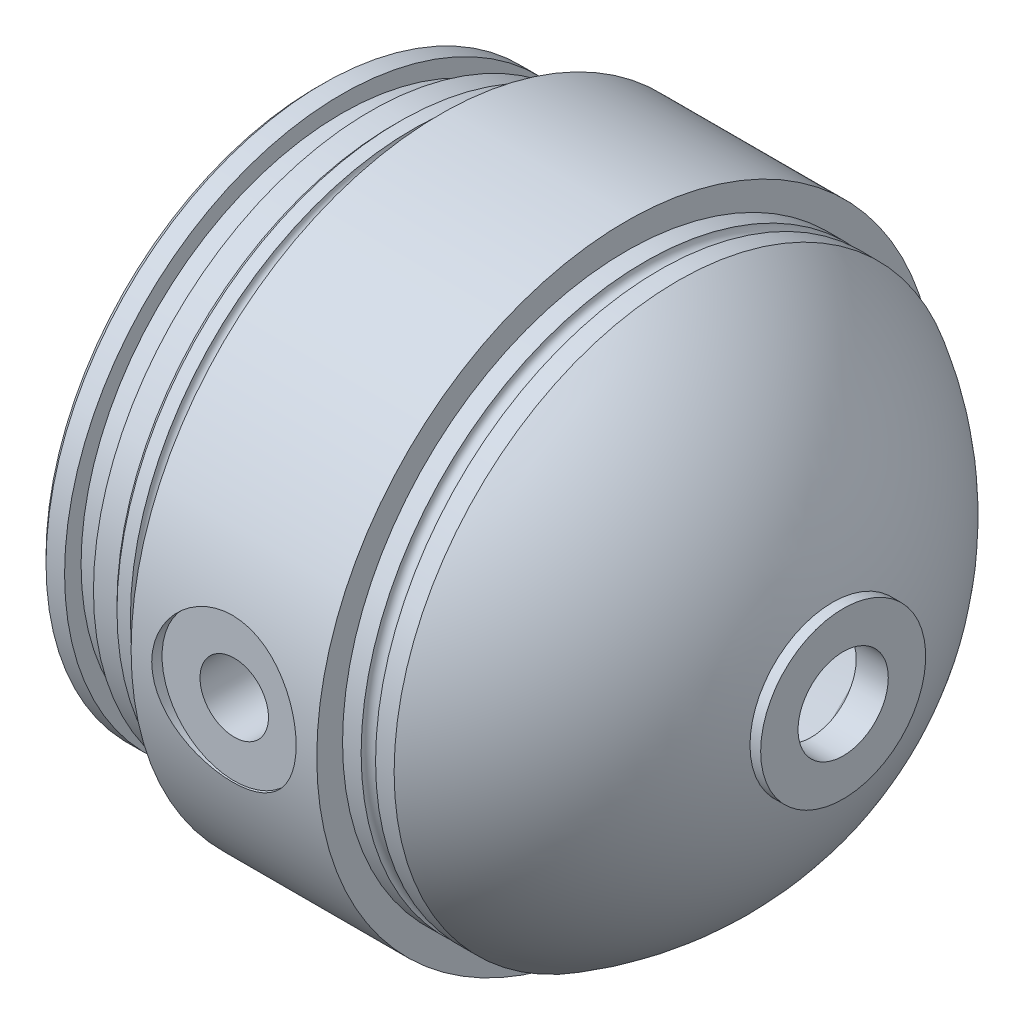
ISO-10303-21;
HEADER;
FILE_DESCRIPTION(('STEP AP214'),'2;1');
FILE_NAME('part.step','',(''),(''),'','','');
FILE_SCHEMA(('AUTOMOTIVE_DESIGN { 1 0 10303 214 1 1 1 1 }'));
ENDSEC;
DATA;
#1=APPLICATION_CONTEXT('core data for automotive mechanical design processes');
#2=APPLICATION_PROTOCOL_DEFINITION('international standard','automotive_design',2000,#1);
#3=PRODUCT_CONTEXT('',#1,'mechanical');
#4=PRODUCT('Part','Part','',(#3));
#5=PRODUCT_RELATED_PRODUCT_CATEGORY('part','',(#4));
#6=PRODUCT_DEFINITION_FORMATION('','',#4);
#7=PRODUCT_DEFINITION_CONTEXT('part definition',#1,'design');
#8=PRODUCT_DEFINITION('design','',#6,#7);
#9=PRODUCT_DEFINITION_SHAPE('','',#8);
#10=(LENGTH_UNIT() NAMED_UNIT(*) SI_UNIT(.MILLI.,.METRE.));
#11=(NAMED_UNIT(*) PLANE_ANGLE_UNIT() SI_UNIT($,.RADIAN.));
#12=(NAMED_UNIT(*) SI_UNIT($,.STERADIAN.) SOLID_ANGLE_UNIT());
#13=UNCERTAINTY_MEASURE_WITH_UNIT(LENGTH_MEASURE(1.E-05),#10,'distance_accuracy_value','');
#14=(GEOMETRIC_REPRESENTATION_CONTEXT(3) GLOBAL_UNCERTAINTY_ASSIGNED_CONTEXT((#13)) GLOBAL_UNIT_ASSIGNED_CONTEXT((#10,
#11,#12)) REPRESENTATION_CONTEXT('',''));
#15=CARTESIAN_POINT('',(0.,0.,0.));
#16=DIRECTION('',(0.,0.,1.));
#17=DIRECTION('',(1.,0.,0.));
#18=AXIS2_PLACEMENT_3D('',#15,#16,#17);
#19=CARTESIAN_POINT('',(-50.594587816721,0.,0.));
#20=DIRECTION('',(-1.,0.,0.));
#21=DIRECTION('',(0.,0.,1.));
#22=AXIS2_PLACEMENT_3D('',#19,#20,#21);
#23=CYLINDRICAL_SURFACE('',#22,38.1);
#24=CARTESIAN_POINT('',(20.32,0.,38.1));
#25=CARTESIAN_POINT('',(20.3200064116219,0.246186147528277,38.1000036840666));
#26=CARTESIAN_POINT('',(20.309771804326,0.49229873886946,38.097610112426));
#27=CARTESIAN_POINT('',(20.2689319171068,0.982807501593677,38.0881107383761));
#28=CARTESIAN_POINT('',(20.2383239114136,1.22720343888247,38.0810043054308));
#29=CARTESIAN_POINT('',(20.1569657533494,1.71252722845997,38.0622684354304));
#30=CARTESIAN_POINT('',(20.1062078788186,1.95345371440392,38.0506372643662));
#31=CARTESIAN_POINT('',(19.9849430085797,2.43013375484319,38.0231700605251));
#32=CARTESIAN_POINT('',(19.9144287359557,2.66588536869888,38.007332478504));
#33=CARTESIAN_POINT('',(19.7543370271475,3.13012995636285,37.9719160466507));
#34=CARTESIAN_POINT('',(19.6647885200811,3.35863334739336,37.9523428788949));
#35=CARTESIAN_POINT('',(19.4672089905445,3.8072927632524,37.9099633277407));
#36=CARTESIAN_POINT('',(19.3591710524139,4.0274456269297,37.8871557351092));
#37=CARTESIAN_POINT('',(19.1254762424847,4.45776485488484,37.8389375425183));
#38=CARTESIAN_POINT('',(18.999827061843,4.66793552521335,37.8135280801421));
#39=CARTESIAN_POINT('',(18.7316949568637,5.07712644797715,37.760764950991));
#40=CARTESIAN_POINT('',(18.5892043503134,5.27614155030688,37.7334103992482));
#41=CARTESIAN_POINT('',(18.2859517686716,5.66478230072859,37.6770411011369));
#42=CARTESIAN_POINT('',(18.1249304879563,5.85420279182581,37.6480065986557));
#43=CARTESIAN_POINT('',(17.7877094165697,6.21878323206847,37.5895040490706));
#44=CARTESIAN_POINT('',(17.6115162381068,6.39394932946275,37.5600361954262));
#45=CARTESIAN_POINT('',(17.2449649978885,6.72903958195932,37.5014530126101));
#46=CARTESIAN_POINT('',(17.0545997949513,6.88895595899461,37.4723378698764));
#47=CARTESIAN_POINT('',(16.6611091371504,7.19230760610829,37.4152980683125));
#48=CARTESIAN_POINT('',(16.4579884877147,7.33574902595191,37.3873729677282));
#49=CARTESIAN_POINT('',(16.0375051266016,7.6069974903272,37.3331351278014));
#50=CARTESIAN_POINT('',(15.8199900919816,7.73457378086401,37.3068484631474));
#51=CARTESIAN_POINT('',(15.374741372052,7.97086003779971,37.2570794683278));
#52=CARTESIAN_POINT('',(15.147011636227,8.0795772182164,37.23359606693));
#53=CARTESIAN_POINT('',(14.6828260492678,8.27737123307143,37.1901248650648));
#54=CARTESIAN_POINT('',(14.4463694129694,8.36644629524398,37.1701373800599));
#55=CARTESIAN_POINT('',(13.9664496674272,8.52421977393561,37.134272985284));
#56=CARTESIAN_POINT('',(13.7229867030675,8.59291861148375,37.1183959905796));
#57=CARTESIAN_POINT('',(13.2351782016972,8.70833753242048,37.0914856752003));
#58=CARTESIAN_POINT('',(12.9909235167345,8.75542296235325,37.0803720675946));
#59=CARTESIAN_POINT('',(12.4991593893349,8.82897534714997,37.0629279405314));
#60=CARTESIAN_POINT('',(12.2516499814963,8.85544252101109,37.0565973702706));
#61=CARTESIAN_POINT('',(11.7552368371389,8.88752934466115,37.0489149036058));
#62=CARTESIAN_POINT('',(11.5063332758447,8.89315155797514,37.047562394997));
#63=CARTESIAN_POINT('',(11.0089563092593,8.88350658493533,37.0498763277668));
#64=CARTESIAN_POINT('',(10.7604828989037,8.86823964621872,37.0535427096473));
#65=CARTESIAN_POINT('',(10.2710409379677,8.81749195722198,37.0656511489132));
#66=CARTESIAN_POINT('',(10.0300247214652,8.78244496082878,37.0739907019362));
#67=CARTESIAN_POINT('',(9.55178102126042,8.6927329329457,37.0951279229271));
#68=CARTESIAN_POINT('',(9.31455493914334,8.63806081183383,37.1079272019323));
#69=CARTESIAN_POINT('',(8.84565990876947,8.50954600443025,37.1376085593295));
#70=CARTESIAN_POINT('',(8.61399007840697,8.43570638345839,37.1544899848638));
#71=CARTESIAN_POINT('',(8.15772150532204,8.26941690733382,37.1918539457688));
#72=CARTESIAN_POINT('',(7.93312306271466,8.1769662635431,37.2123366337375));
#73=CARTESIAN_POINT('',(7.49052156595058,7.97323569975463,37.2565224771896));
#74=CARTESIAN_POINT('',(7.27259497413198,7.86179556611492,37.280252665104));
#75=CARTESIAN_POINT('',(6.84687084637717,7.62146837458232,37.3301255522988));
#76=CARTESIAN_POINT('',(6.63907357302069,7.49258086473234,37.356268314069));
#77=CARTESIAN_POINT('',(6.23492121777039,7.21823488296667,37.4102475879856));
#78=CARTESIAN_POINT('',(6.03856748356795,7.072774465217,37.4380842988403));
#79=CARTESIAN_POINT('',(5.65857316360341,6.76626347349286,37.4946924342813));
#80=CARTESIAN_POINT('',(5.47493279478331,6.60521263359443,37.5234638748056));
#81=CARTESIAN_POINT('',(5.11715718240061,6.26439575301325,37.5818834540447));
#82=CARTESIAN_POINT('',(4.94336966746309,6.0842651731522,37.611535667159));
#83=CARTESIAN_POINT('',(4.61154951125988,5.70993782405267,37.6701804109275));
#84=CARTESIAN_POINT('',(4.45351676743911,5.51574114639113,37.699172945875));
#85=CARTESIAN_POINT('',(4.15428798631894,5.11456132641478,37.7556921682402));
#86=CARTESIAN_POINT('',(4.01309292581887,4.90757744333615,37.783218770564));
#87=CARTESIAN_POINT('',(3.74856553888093,4.48222994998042,37.8360348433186));
#88=CARTESIAN_POINT('',(3.62523257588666,4.26386674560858,37.8613243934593));
#89=CARTESIAN_POINT('',(3.39700744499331,3.81658864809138,37.909027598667));
#90=CARTESIAN_POINT('',(3.29217023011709,3.58764477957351,37.9314326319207));
#91=CARTESIAN_POINT('',(3.10223524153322,3.12149800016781,37.9726344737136));
#92=CARTESIAN_POINT('',(3.01712974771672,2.88429836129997,37.9914326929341));
#93=CARTESIAN_POINT('',(2.86729124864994,2.40324525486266,38.0248937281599));
#94=CARTESIAN_POINT('',(2.80255952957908,2.15939136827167,38.0395562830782));
#95=CARTESIAN_POINT('',(2.69402128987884,1.66684364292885,38.0643196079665));
#96=CARTESIAN_POINT('',(2.65021432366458,1.41814990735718,38.0744204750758));
#97=CARTESIAN_POINT('',(2.58464751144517,0.923417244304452,38.0895939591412));
#98=CARTESIAN_POINT('',(2.56241428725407,0.677444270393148,38.0947744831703));
#99=CARTESIAN_POINT('',(2.53848830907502,0.184448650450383,38.1003509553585));
#100=CARTESIAN_POINT('',(2.53679524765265,-0.0625739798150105,38.1007469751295));
#101=CARTESIAN_POINT('',(2.55396287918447,-0.555845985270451,38.0967435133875));
#102=CARTESIAN_POINT('',(2.57282209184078,-0.802095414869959,38.0923443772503));
#103=CARTESIAN_POINT('',(2.63093329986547,-1.29204553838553,38.0788744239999));
#104=CARTESIAN_POINT('',(2.67018523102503,-1.5357462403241,38.0698036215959));
#105=CARTESIAN_POINT('',(2.76812002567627,-2.01572701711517,38.0473892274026));
#106=CARTESIAN_POINT('',(2.82654588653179,-2.25206225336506,38.0341022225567));
#107=CARTESIAN_POINT('',(2.96251485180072,-2.71899726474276,38.0035763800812));
#108=CARTESIAN_POINT('',(3.04006488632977,-2.94959492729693,37.9863361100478));
#109=CARTESIAN_POINT('',(3.2136537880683,-3.40334301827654,37.9483738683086));
#110=CARTESIAN_POINT('',(3.30968708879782,-3.62649566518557,37.9276529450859));
#111=CARTESIAN_POINT('',(3.51959205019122,-4.06404324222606,37.8832671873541));
#112=CARTESIAN_POINT('',(3.63347049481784,-4.27843480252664,37.8596012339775));
#113=CARTESIAN_POINT('',(3.88013204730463,-4.7002343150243,37.8095702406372));
#114=CARTESIAN_POINT('',(4.01318040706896,-4.90748287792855,37.783169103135));
#115=CARTESIAN_POINT('',(4.29594978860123,-5.31017771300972,37.7286803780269));
#116=CARTESIAN_POINT('',(4.44567832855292,-5.50561860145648,37.700592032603));
#117=CARTESIAN_POINT('',(4.76076857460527,-5.88336238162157,37.6434927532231));
#118=CARTESIAN_POINT('',(4.92613233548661,-6.06566354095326,37.6144816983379));
#119=CARTESIAN_POINT('',(5.2713115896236,-6.41584572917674,37.556336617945));
#120=CARTESIAN_POINT('',(5.45112078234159,-6.58373297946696,37.5272026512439));
#121=CARTESIAN_POINT('',(5.82812834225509,-6.90754706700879,37.4689664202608));
#122=CARTESIAN_POINT('',(6.02561862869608,-7.06313682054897,37.4398784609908));
#123=CARTESIAN_POINT('',(6.43313362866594,-7.35707279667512,37.383229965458));
#124=CARTESIAN_POINT('',(6.64315365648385,-7.49542540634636,37.3556688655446));
#125=CARTESIAN_POINT('',(7.07445553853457,-7.75400377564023,37.3028531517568));
#126=CARTESIAN_POINT('',(7.29574143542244,-7.8742229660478,37.2775993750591));
#127=CARTESIAN_POINT('',(7.74789407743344,-8.09552487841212,37.2301663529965));
#128=CARTESIAN_POINT('',(7.97875696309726,-8.19661521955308,37.2079858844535));
#129=CARTESIAN_POINT('',(8.4471761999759,-8.37840170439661,37.1674725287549));
#130=CARTESIAN_POINT('',(8.68468666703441,-8.45921128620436,37.1491183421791));
#131=CARTESIAN_POINT('',(9.16595935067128,-8.60052999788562,37.1166559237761));
#132=CARTESIAN_POINT('',(9.40972155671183,-8.66103916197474,37.1025476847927));
#133=CARTESIAN_POINT('',(9.90167289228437,-8.761239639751,37.0790147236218));
#134=CARTESIAN_POINT('',(10.1498613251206,-8.80093420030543,37.0695892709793));
#135=CARTESIAN_POINT('',(10.6488437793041,-8.85917518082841,37.0557136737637));
#136=CARTESIAN_POINT('',(10.8996377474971,-8.87772203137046,37.0512634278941));
#137=CARTESIAN_POINT('',(11.3956623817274,-8.89330926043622,37.0475250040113));
#138=CARTESIAN_POINT('',(11.6408757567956,-8.89087460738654,37.0481108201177));
#139=CARTESIAN_POINT('',(12.1302011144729,-8.86576750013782,37.0541270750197));
#140=CARTESIAN_POINT('',(12.3743131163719,-8.84309540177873,37.0595574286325));
#141=CARTESIAN_POINT('',(12.8596781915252,-8.77770382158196,37.0751000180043));
#142=CARTESIAN_POINT('',(13.1009313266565,-8.73498477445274,37.085212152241));
#143=CARTESIAN_POINT('',(13.5788774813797,-8.62984924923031,37.1098182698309));
#144=CARTESIAN_POINT('',(13.8155704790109,-8.56743267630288,37.1243122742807));
#145=CARTESIAN_POINT('',(14.2816498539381,-8.42373928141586,37.1571798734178));
#146=CARTESIAN_POINT('',(14.5110654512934,-8.34255289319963,37.1755348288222));
#147=CARTESIAN_POINT('',(14.9622984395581,-8.16174406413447,37.2156486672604));
#148=CARTESIAN_POINT('',(15.1841130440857,-8.06211494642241,37.2374087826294));
#149=CARTESIAN_POINT('',(15.6185850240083,-7.84517732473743,37.2837160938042));
#150=CARTESIAN_POINT('',(15.8312433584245,-7.72787067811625,37.3082629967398));
#151=CARTESIAN_POINT('',(16.2460779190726,-7.47638492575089,37.3594717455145));
#152=CARTESIAN_POINT('',(16.4482536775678,-7.34220506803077,37.3861336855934));
#153=CARTESIAN_POINT('',(16.845338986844,-7.05462009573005,37.4414777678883));
#154=CARTESIAN_POINT('',(17.0399764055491,-6.90084531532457,37.4701921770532));
#155=CARTESIAN_POINT('',(17.41567343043,-6.57763029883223,37.528279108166));
#156=CARTESIAN_POINT('',(17.5967328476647,-6.40818984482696,37.5576516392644));
#157=CARTESIAN_POINT('',(17.9441246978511,-6.05472522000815,37.6162517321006));
#158=CARTESIAN_POINT('',(18.1104535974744,-5.87069757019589,37.6454792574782));
#159=CARTESIAN_POINT('',(18.4272188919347,-5.48930574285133,37.7029800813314));
#160=CARTESIAN_POINT('',(18.5776556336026,-5.29194185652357,37.7312534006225));
#161=CARTESIAN_POINT('',(18.8638038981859,-4.88201767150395,37.7864965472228));
#162=CARTESIAN_POINT('',(18.9992518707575,-4.66926963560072,37.8134394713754));
#163=CARTESIAN_POINT('',(19.2516555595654,-4.23288563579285,37.8647716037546));
#164=CARTESIAN_POINT('',(19.368618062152,-4.00925370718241,37.889161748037));
#165=CARTESIAN_POINT('',(19.5831656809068,-3.55268361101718,37.9346940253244));
#166=CARTESIAN_POINT('',(19.6807603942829,-3.31975012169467,37.9558377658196));
#167=CARTESIAN_POINT('',(19.8558462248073,-2.84622033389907,37.9942827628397));
#168=CARTESIAN_POINT('',(19.9333406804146,-2.60562531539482,38.0115846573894));
#169=CARTESIAN_POINT('',(20.1061854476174,-1.97839265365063,38.0505356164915));
#170=CARTESIAN_POINT('',(20.1862379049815,-1.58722346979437,38.0689762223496));
#171=CARTESIAN_POINT('',(20.2931384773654,-0.797304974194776,38.0937050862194));
#172=CARTESIAN_POINT('',(20.3199896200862,-0.398556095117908,38.0999940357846));
#173=CARTESIAN_POINT('',(20.32,0.,38.1));
#174=B_SPLINE_CURVE_WITH_KNOTS('',3,(#24,#25,#26,#27,#28,#29,#30,#31,#32,#33,#34,#35,#36,#37,
#38,#39,#40,#41,#42,#43,#44,#45,#46,#47,#48,#49,#50,#51,#52,#53,#54,#55,#56,#57,#58,#59,#60,#61,
#62,#63,#64,#65,#66,#67,#68,#69,#70,#71,#72,#73,#74,#75,#76,#77,#78,#79,#80,#81,#82,#83,#84,#85,
#86,#87,#88,#89,#90,#91,#92,#93,#94,#95,#96,#97,#98,#99,#100,#101,#102,#103,#104,#105,#106,#107,
#108,#109,#110,#111,#112,#113,#114,#115,#116,#117,#118,#119,#120,#121,#122,#123,#124,#125,#126,
#127,#128,#129,#130,#131,#132,#133,#134,#135,#136,#137,#138,#139,#140,#141,#142,#143,#144,#145,
#146,#147,#148,#149,#150,#151,#152,#153,#154,#155,#156,#157,#158,#159,#160,#161,#162,#163,#164,
#165,#166,#167,#168,#169,#170,#171,#172,#173),.UNSPECIFIED.,.T.,.F.,(4,2,2,2,2,2,2,2,2,2,2,2,2,
2,2,2,2,2,2,2,2,2,2,2,2,2,2,2,2,2,2,2,2,2,2,2,2,2,2,2,2,2,2,2,2,2,2,2,2,2,2,2,2,2,2,2,2,2,2,2,2,
2,2,2,2,2,2,2,2,2,2,2,2,2,4),(0.,0.738207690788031,1.47651416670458,2.21510386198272,
2.95396596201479,3.69171303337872,4.42973665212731,5.16743896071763,5.90547908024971,
6.65551355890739,7.40522279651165,8.15531239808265,8.90512109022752,9.66480358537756,
10.4241948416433,11.1836545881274,11.9430986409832,12.6891842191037,13.4352618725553,
14.1812477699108,14.9272248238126,15.6574458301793,16.3879308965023,17.1182992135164,
17.8486984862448,18.5855964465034,19.3225134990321,20.059517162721,20.7965333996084,
21.5517902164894,22.3070421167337,23.0623378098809,23.8176065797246,24.575082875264,
25.3322623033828,26.0894895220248,26.8467006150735,27.5868934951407,28.3270752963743,
29.0672037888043,29.8073299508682,30.5379153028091,31.2687657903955,31.9993965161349,
32.730305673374,33.4725243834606,34.215078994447,34.9577313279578,35.700061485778,
36.4584417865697,37.2165402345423,37.9749126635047,38.732982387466,39.4867123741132,
40.2404410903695,40.9940521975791,41.747647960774,42.4824441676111,43.2172274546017,
43.9519948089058,44.6867657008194,45.4180676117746,46.1496347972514,46.8811251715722,
47.6126481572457,48.3609103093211,49.1091828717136,49.8576344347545,50.6060696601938,
51.3660734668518,52.1257976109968,52.8851443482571,53.6443648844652,54.8395333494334,
56.0346337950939),.UNSPECIFIED.);
#175=CARTESIAN_POINT('',(20.32,0.,38.1));
#176=VERTEX_POINT('',#175);
#177=EDGE_CURVE('E48',#176,#176,#174,.T.);
#178=ORIENTED_EDGE('',*,*,#177,.F.);
#179=EDGE_LOOP('',(#178));
#180=FACE_BOUND('',#179,.T.);
#181=CARTESIAN_POINT('',(22.86,0.,0.));
#182=DIRECTION('',(-1.,0.,0.));
#183=DIRECTION('',(0.,0.,1.));
#184=AXIS2_PLACEMENT_3D('',#181,#182,#183);
#185=CIRCLE('',#184,38.1);
#186=CARTESIAN_POINT('',(22.86,0.,38.1));
#187=VERTEX_POINT('',#186);
#188=EDGE_CURVE('E142',#187,#187,#185,.T.);
#189=ORIENTED_EDGE('',*,*,#188,.T.);
#190=EDGE_LOOP('',(#189));
#191=FACE_BOUND('',#190,.T.);
#192=CARTESIAN_POINT('',(0.,0.,0.));
#193=DIRECTION('',(-1.,0.,0.));
#194=DIRECTION('',(0.,0.,1.));
#195=AXIS2_PLACEMENT_3D('',#192,#193,#194);
#196=CIRCLE('',#195,38.1);
#197=CARTESIAN_POINT('',(0.,0.,38.1));
#198=VERTEX_POINT('',#197);
#199=EDGE_CURVE('E145',#198,#198,#196,.T.);
#200=ORIENTED_EDGE('',*,*,#199,.F.);
#201=EDGE_LOOP('',(#200));
#202=FACE_BOUND('',#201,.T.);
#203=CARTESIAN_POINT('',(1.26999999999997,0.,-38.1));
#204=CARTESIAN_POINT('',(1.27000100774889,-0.280066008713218,-38.0999994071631));
#205=CARTESIAN_POINT('',(1.28158997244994,-0.560151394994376,-38.0969043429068));
#206=CARTESIAN_POINT('',(1.32784857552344,-1.11828861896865,-38.0846081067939));
#207=CARTESIAN_POINT('',(1.36252035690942,-1.39634026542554,-38.0754063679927));
#208=CARTESIAN_POINT('',(1.45466372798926,-1.948496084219,-38.0511466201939));
#209=CARTESIAN_POINT('',(1.51214456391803,-2.2225986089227,-38.0360862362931));
#210=CARTESIAN_POINT('',(1.64942210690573,-2.76479794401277,-38.0005225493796));
#211=CARTESIAN_POINT('',(1.72921934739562,-3.03289461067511,-37.9800191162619));
#212=CARTESIAN_POINT('',(1.91035850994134,-3.56087311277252,-37.9341576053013));
#213=CARTESIAN_POINT('',(2.0116716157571,-3.82076540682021,-37.9088060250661));
#214=CARTESIAN_POINT('',(2.23511986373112,-4.3309748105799,-37.853909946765));
#215=CARTESIAN_POINT('',(2.35725508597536,-4.58129188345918,-37.8243654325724));
#216=CARTESIAN_POINT('',(2.62142775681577,-5.07069737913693,-37.7618707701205));
#217=CARTESIAN_POINT('',(2.76346238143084,-5.30978738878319,-37.7289211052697));
#218=CARTESIAN_POINT('',(3.06650532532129,-5.77535582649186,-37.6604654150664));
#219=CARTESIAN_POINT('',(3.22752045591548,-6.00182968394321,-37.6249584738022));
#220=CARTESIAN_POINT('',(3.57088725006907,-6.44516533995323,-37.551582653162));
#221=CARTESIAN_POINT('',(3.75360786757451,-6.66173591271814,-37.5136803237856));
#222=CARTESIAN_POINT('',(4.13651170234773,-7.07890016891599,-37.4372030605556));
#223=CARTESIAN_POINT('',(4.33670285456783,-7.27948651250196,-37.3986278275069));
#224=CARTESIAN_POINT('',(4.75320491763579,-7.66330305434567,-37.3218716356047));
#225=CARTESIAN_POINT('',(4.96951791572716,-7.8465309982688,-37.2836907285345));
#226=CARTESIAN_POINT('',(5.41675323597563,-8.19430715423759,-37.2088022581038));
#227=CARTESIAN_POINT('',(5.64766893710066,-8.35886373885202,-37.1720940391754));
#228=CARTESIAN_POINT('',(6.1269181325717,-8.67099371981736,-37.1005386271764));
#229=CARTESIAN_POINT('',(6.37548720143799,-8.81821588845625,-37.0657357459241));
#230=CARTESIAN_POINT('',(6.88453811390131,-9.09108019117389,-36.9997563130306));
#231=CARTESIAN_POINT('',(7.14501524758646,-9.21673076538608,-36.968578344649));
#232=CARTESIAN_POINT('',(7.67618374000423,-9.4455327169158,-36.9107822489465));
#233=CARTESIAN_POINT('',(7.9468757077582,-9.54868275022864,-36.8841643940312));
#234=CARTESIAN_POINT('',(8.49651063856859,-9.73160431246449,-36.8363248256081));
#235=CARTESIAN_POINT('',(8.77545337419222,-9.81137648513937,-36.8151029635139));
#236=CARTESIAN_POINT('',(9.3331430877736,-9.94530864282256,-36.7791454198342));
#237=CARTESIAN_POINT('',(9.61175220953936,-10.0000063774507,-36.7642740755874));
#238=CARTESIAN_POINT('',(10.1728309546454,-10.0859143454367,-36.7407991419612));
#239=CARTESIAN_POINT('',(10.4553005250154,-10.1171249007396,-36.7321954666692));
#240=CARTESIAN_POINT('',(11.0219386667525,-10.1557725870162,-36.7215289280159));
#241=CARTESIAN_POINT('',(11.3061069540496,-10.1632135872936,-36.7194650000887));
#242=CARTESIAN_POINT('',(11.874036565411,-10.1542643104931,-36.7219408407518));
#243=CARTESIAN_POINT('',(12.1577978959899,-10.1378744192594,-36.7264805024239));
#244=CARTESIAN_POINT('',(12.7148793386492,-10.0822045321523,-36.7418011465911));
#245=CARTESIAN_POINT('',(12.9882697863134,-10.043576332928,-36.7524043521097));
#246=CARTESIAN_POINT('',(13.5307192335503,-9.9442749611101,-36.7793969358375));
#247=CARTESIAN_POINT('',(13.7997783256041,-9.88360225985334,-36.7957861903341));
#248=CARTESIAN_POINT('',(14.3316900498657,-9.74071992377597,-36.833868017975));
#249=CARTESIAN_POINT('',(14.5945434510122,-9.65851297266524,-36.8555599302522));
#250=CARTESIAN_POINT('',(15.112429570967,-9.47317175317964,-36.9036336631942));
#251=CARTESIAN_POINT('',(15.3674593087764,-9.37002961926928,-36.9300172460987));
#252=CARTESIAN_POINT('',(15.8707252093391,-9.14235632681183,-36.9870414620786));
#253=CARTESIAN_POINT('',(16.1188551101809,-9.01760133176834,-37.0177259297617));
#254=CARTESIAN_POINT('',(16.6037724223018,-8.74840492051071,-37.0822674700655));
#255=CARTESIAN_POINT('',(16.8405592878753,-8.60396255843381,-37.1161246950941));
#256=CARTESIAN_POINT('',(17.3013440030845,-8.29636460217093,-37.1860888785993));
#257=CARTESIAN_POINT('',(17.525340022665,-8.13320634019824,-37.2221961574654));
#258=CARTESIAN_POINT('',(17.9591389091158,-7.78925991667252,-37.2956880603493));
#259=CARTESIAN_POINT('',(18.1689414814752,-7.60847138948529,-37.3330727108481));
#260=CARTESIAN_POINT('',(18.5796736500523,-7.22422395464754,-37.4093595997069));
#261=CARTESIAN_POINT('',(18.7800894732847,-7.02021738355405,-37.4482715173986));
#262=CARTESIAN_POINT('',(19.1630795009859,-6.59596466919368,-37.5253210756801));
#263=CARTESIAN_POINT('',(19.3456539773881,-6.37571877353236,-37.5634587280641));
#264=CARTESIAN_POINT('',(19.6917646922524,-5.92035886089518,-37.6379140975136));
#265=CARTESIAN_POINT('',(19.8552959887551,-5.68524100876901,-37.674231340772));
#266=CARTESIAN_POINT('',(20.1620381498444,-5.20182862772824,-37.7440138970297));
#267=CARTESIAN_POINT('',(20.305256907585,-4.9535392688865,-37.7774803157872));
#268=CARTESIAN_POINT('',(20.570982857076,-4.44420016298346,-37.8407879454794));
#269=CARTESIAN_POINT('',(20.6933923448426,-4.18309725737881,-37.8706118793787));
#270=CARTESIAN_POINT('',(20.9157210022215,-3.65100439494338,-37.9256073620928));
#271=CARTESIAN_POINT('',(21.015640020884,-3.38001437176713,-37.9507788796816));
#272=CARTESIAN_POINT('',(21.1921316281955,-2.83014925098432,-37.9957409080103));
#273=CARTESIAN_POINT('',(21.2687083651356,-2.55127556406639,-38.0155323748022));
#274=CARTESIAN_POINT('',(21.3978646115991,-1.98767441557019,-38.0491633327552));
#275=CARTESIAN_POINT('',(21.4504448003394,-1.70294711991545,-38.0630029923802));
#276=CARTESIAN_POINT('',(21.5299663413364,-1.13809584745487,-38.0840162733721));
#277=CARTESIAN_POINT('',(21.5576045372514,-0.85807653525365,-38.0913709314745));
#278=CARTESIAN_POINT('',(21.5895608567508,-0.29661834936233,-38.0998797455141));
#279=CARTESIAN_POINT('',(21.5938794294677,-0.0151795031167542,-38.1010340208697));
#280=CARTESIAN_POINT('',(21.579159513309,0.547014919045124,-38.0971099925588));
#281=CARTESIAN_POINT('',(21.5601232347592,0.827770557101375,-38.0920322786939));
#282=CARTESIAN_POINT('',(21.4988652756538,1.38656075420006,-38.0757872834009));
#283=CARTESIAN_POINT('',(21.456643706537,1.66459532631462,-38.0646200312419));
#284=CARTESIAN_POINT('',(21.3503066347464,2.21117495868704,-38.0367493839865));
#285=CARTESIAN_POINT('',(21.2865806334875,2.47980098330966,-38.0201446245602));
#286=CARTESIAN_POINT('',(21.1376089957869,3.01063471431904,-37.9817969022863));
#287=CARTESIAN_POINT('',(21.052363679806,3.27284251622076,-37.960054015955));
#288=CARTESIAN_POINT('',(20.8610285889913,3.78907245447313,-37.9120051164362));
#289=CARTESIAN_POINT('',(20.7549408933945,4.04309540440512,-37.8856995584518));
#290=CARTESIAN_POINT('',(20.522663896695,4.54143916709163,-37.8291983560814));
#291=CARTESIAN_POINT('',(20.3964670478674,4.78575629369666,-37.7990012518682));
#292=CARTESIAN_POINT('',(20.1222603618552,5.26768961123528,-37.7348868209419));
#293=CARTESIAN_POINT('',(19.9738751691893,5.50508415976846,-37.700908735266));
#294=CARTESIAN_POINT('',(19.6582081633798,5.96660362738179,-37.6306276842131));
#295=CARTESIAN_POINT('',(19.4909254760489,6.19072793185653,-37.5943246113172));
#296=CARTESIAN_POINT('',(19.1385591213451,6.62433178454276,-37.5203493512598));
#297=CARTESIAN_POINT('',(18.9534727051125,6.83380906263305,-37.4826769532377));
#298=CARTESIAN_POINT('',(18.5667122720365,7.23677644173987,-37.4069660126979));
#299=CARTESIAN_POINT('',(18.3650380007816,7.43026629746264,-37.3689274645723));
#300=CARTESIAN_POINT('',(17.9404472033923,7.80526420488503,-37.2924322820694));
#301=CARTESIAN_POINT('',(17.7170914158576,7.98627908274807,-37.2539942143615));
#302=CARTESIAN_POINT('',(17.2556568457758,8.32885896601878,-37.1789035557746));
#303=CARTESIAN_POINT('',(17.0175784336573,8.49042446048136,-37.1422509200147));
#304=CARTESIAN_POINT('',(16.5282174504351,8.79298279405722,-37.0717897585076));
#305=CARTESIAN_POINT('',(16.2769322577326,8.93397152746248,-37.0379818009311));
#306=CARTESIAN_POINT('',(15.7630016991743,9.19421681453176,-36.9742387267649));
#307=CARTESIAN_POINT('',(15.5003609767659,9.31348214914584,-36.9443020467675));
#308=CARTESIAN_POINT('',(14.9669665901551,9.52878337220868,-36.8893557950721));
#309=CARTESIAN_POINT('',(14.6962672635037,9.62494692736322,-36.8643192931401));
#310=CARTESIAN_POINT('',(14.1472765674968,9.79410565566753,-36.8197386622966));
#311=CARTESIAN_POINT('',(13.8689852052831,9.86710085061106,-36.8001945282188));
#312=CARTESIAN_POINT('',(13.3069240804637,9.98926656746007,-36.7672213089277));
#313=CARTESIAN_POINT('',(13.0231555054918,10.0384421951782,-36.7537909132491));
#314=CARTESIAN_POINT('',(12.4522394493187,10.112540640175,-36.7334725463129));
#315=CARTESIAN_POINT('',(12.165092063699,10.1374641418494,-36.7265843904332));
#316=CARTESIAN_POINT('',(11.5990890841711,10.1624113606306,-36.7196888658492));
#317=CARTESIAN_POINT('',(11.3202706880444,10.1632255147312,-36.7194630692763));
#318=CARTESIAN_POINT('',(10.7635812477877,10.1419460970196,-36.725346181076));
#319=CARTESIAN_POINT('',(10.4857101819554,10.119853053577,-36.7314549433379));
#320=CARTESIAN_POINT('',(9.93293383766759,10.0529549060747,-36.7498203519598));
#321=CARTESIAN_POINT('',(9.65802846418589,10.0081505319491,-36.7620768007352));
#322=CARTESIAN_POINT('',(9.11312783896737,9.89621474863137,-36.7923672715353));
#323=CARTESIAN_POINT('',(8.84313261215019,9.8290832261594,-36.8104013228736));
#324=CARTESIAN_POINT('',(8.31204510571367,9.67367061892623,-36.8515467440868));
#325=CARTESIAN_POINT('',(8.05089913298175,9.58556181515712,-36.8746166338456));
#326=CARTESIAN_POINT('',(7.53691178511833,9.38856967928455,-36.9252636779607));
#327=CARTESIAN_POINT('',(7.2840734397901,9.27967886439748,-36.9528424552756));
#328=CARTESIAN_POINT('',(6.78843297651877,9.04195743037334,-37.0117277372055));
#329=CARTESIAN_POINT('',(6.54563007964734,8.91312836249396,-37.0430339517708));
#330=CARTESIAN_POINT('',(6.07153116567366,8.63642018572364,-37.1085226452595));
#331=CARTESIAN_POINT('',(5.84023574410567,8.48854009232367,-37.142705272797));
#332=CARTESIAN_POINT('',(5.38394169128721,8.1700942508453,-37.2140692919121));
#333=CARTESIAN_POINT('',(5.15932855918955,7.99898904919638,-37.2513093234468));
#334=CARTESIAN_POINT('',(4.72521516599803,7.63878363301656,-37.3268380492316));
#335=CARTESIAN_POINT('',(4.51571516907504,7.44968310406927,-37.3651267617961));
#336=CARTESIAN_POINT('',(4.11311487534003,7.05466802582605,-37.4417164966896));
#337=CARTESIAN_POINT('',(3.92001860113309,6.84874937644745,-37.4800175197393));
#338=CARTESIAN_POINT('',(3.55154380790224,6.42145742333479,-37.5555847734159));
#339=CARTESIAN_POINT('',(3.3761649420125,6.2000844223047,-37.5928510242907));
#340=CARTESIAN_POINT('',(3.04070400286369,5.73833583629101,-37.6661294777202));
#341=CARTESIAN_POINT('',(2.88103524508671,5.49765263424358,-37.7020970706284));
#342=CARTESIAN_POINT('',(2.58264550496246,5.00332239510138,-37.7708750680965));
#343=CARTESIAN_POINT('',(2.44391686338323,4.74968014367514,-37.8036866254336));
#344=CARTESIAN_POINT('',(2.18845558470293,4.23118806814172,-37.8652238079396));
#345=CARTESIAN_POINT('',(2.07171499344,3.96634233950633,-37.8939509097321));
#346=CARTESIAN_POINT('',(1.86112989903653,3.42724944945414,-37.9465053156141));
#347=CARTESIAN_POINT('',(1.76728232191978,3.15300355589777,-37.9703332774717));
#348=CARTESIAN_POINT('',(1.61665188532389,2.64246762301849,-38.0089702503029));
#349=CARTESIAN_POINT('',(1.55632049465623,2.40728055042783,-38.024616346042));
#350=CARTESIAN_POINT('',(1.45261676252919,1.93296229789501,-38.0516762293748));
#351=CARTESIAN_POINT('',(1.40924326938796,1.6938313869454,-38.06309030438));
#352=CARTESIAN_POINT('',(1.33973020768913,1.21288707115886,-38.081449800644));
#353=CARTESIAN_POINT('',(1.31359201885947,0.971073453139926,-38.0883948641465));
#354=CARTESIAN_POINT('',(1.27872881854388,0.486177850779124,-38.0976696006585));
#355=CARTESIAN_POINT('',(1.26999912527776,0.243096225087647,-38.1000005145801));
#356=CARTESIAN_POINT('',(1.26999999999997,0.,-38.1));
#357=B_SPLINE_CURVE_WITH_KNOTS('',3,(#203,#204,#205,#206,#207,#208,#209,#210,#211,#212,#213,
#214,#215,#216,#217,#218,#219,#220,#221,#222,#223,#224,#225,#226,#227,#228,#229,#230,#231,#232,
#233,#234,#235,#236,#237,#238,#239,#240,#241,#242,#243,#244,#245,#246,#247,#248,#249,#250,#251,
#252,#253,#254,#255,#256,#257,#258,#259,#260,#261,#262,#263,#264,#265,#266,#267,#268,#269,#270,
#271,#272,#273,#274,#275,#276,#277,#278,#279,#280,#281,#282,#283,#284,#285,#286,#287,#288,#289,
#290,#291,#292,#293,#294,#295,#296,#297,#298,#299,#300,#301,#302,#303,#304,#305,#306,#307,#308,
#309,#310,#311,#312,#313,#314,#315,#316,#317,#318,#319,#320,#321,#322,#323,#324,#325,#326,#327,
#328,#329,#330,#331,#332,#333,#334,#335,#336,#337,#338,#339,#340,#341,#342,#343,#344,#345,#346,
#347,#348,#349,#350,#351,#352,#353,#354,#355,#356),.UNSPECIFIED.,.T.,.F.,(4,2,2,2,2,2,2,2,2,2,2,
2,2,2,2,2,2,2,2,2,2,2,2,2,2,2,2,2,2,2,2,2,2,2,2,2,2,2,2,2,2,2,2,2,2,2,2,2,2,2,2,2,2,2,2,2,2,2,2,
2,2,2,2,2,2,2,2,2,2,2,2,2,2,2,2,2,4),(0.,0.839975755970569,1.68002950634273,2.52042414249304,
3.36083886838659,4.20013504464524,5.03943444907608,5.87861486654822,6.71809735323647,
7.574744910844,8.43178359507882,9.28893343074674,10.1456973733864,11.0175911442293,
11.8891429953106,12.7607468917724,13.6323267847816,14.4842224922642,15.3361065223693,
16.1878518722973,17.039583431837,17.8675372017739,18.6954732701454,19.5233062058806,
20.3514507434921,21.1887498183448,22.0260891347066,22.8635479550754,23.7010241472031,
24.5658593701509,25.4306814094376,26.2957273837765,27.1604362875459,28.0290993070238,
28.8977681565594,29.7662825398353,30.6347723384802,31.4781705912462,32.3215526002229,
33.1648547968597,34.008152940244,34.8369306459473,35.6656960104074,36.4943787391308,
37.3233732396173,38.1684345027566,39.0135348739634,39.858765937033,40.7040099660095,
41.5731421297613,42.4422524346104,43.3115359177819,44.1804672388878,45.0444800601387,
45.9084920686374,46.7723187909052,47.6361211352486,48.4715707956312,49.3070011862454,
50.1424047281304,50.9778125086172,51.806582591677,52.635651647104,53.4646562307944,
54.2937036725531,55.1471438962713,56.0005990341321,56.8542628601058,57.7079099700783,
58.5800361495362,59.4518425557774,60.323332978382,61.1947063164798,61.9239893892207,
62.6532229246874,63.3825148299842,64.1116105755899),.UNSPECIFIED.);
#358=CARTESIAN_POINT('',(1.26999999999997,0.,-38.1));
#359=VERTEX_POINT('',#358);
#360=EDGE_CURVE('E10',#359,#359,#357,.T.);
#361=ORIENTED_EDGE('',*,*,#360,.T.);
#362=EDGE_LOOP('',(#361));
#363=FACE_BOUND('',#362,.T.);
#364=ADVANCED_FACE('F36',(#180,#191,#202,#363),#23,.T.);
#365=CARTESIAN_POINT('',(11.43,0.,38.1));
#366=DIRECTION('',(0.,0.,-1.));
#367=DIRECTION('',(-1.,0.,0.));
#368=AXIS2_PLACEMENT_3D('',#365,#366,#367);
#369=CYLINDRICAL_SURFACE('',#368,4.2164);
#370=CARTESIAN_POINT('',(15.6464,0.,29.6545));
#371=CARTESIAN_POINT('',(15.6463901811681,0.235562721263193,29.6544963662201));
#372=CARTESIAN_POINT('',(15.6265926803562,0.47126562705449,29.651663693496));
#373=CARTESIAN_POINT('',(15.5479402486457,0.936092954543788,29.6406361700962));
#374=CARTESIAN_POINT('',(15.4890463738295,1.16521057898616,29.6324359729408));
#375=CARTESIAN_POINT('',(15.3339882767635,1.61007229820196,29.6115956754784));
#376=CARTESIAN_POINT('',(15.2378512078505,1.82582600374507,29.5989588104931));
#377=CARTESIAN_POINT('',(15.0110998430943,2.2381029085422,29.5706445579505));
#378=CARTESIAN_POINT('',(14.880490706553,2.43462897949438,29.5549676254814));
#379=CARTESIAN_POINT('',(14.5875207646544,2.8042928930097,29.5221953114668));
#380=CARTESIAN_POINT('',(14.4249650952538,2.97727557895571,29.5050916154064));
#381=CARTESIAN_POINT('',(14.0731355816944,3.29360447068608,29.4714591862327));
#382=CARTESIAN_POINT('',(13.8838602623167,3.43694903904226,29.4549304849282));
#383=CARTESIAN_POINT('',(13.482932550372,3.69052845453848,29.4242385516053));
#384=CARTESIAN_POINT('',(13.2711852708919,3.80061469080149,29.410086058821));
#385=CARTESIAN_POINT('',(12.8319722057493,3.98360302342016,29.3858613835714));
#386=CARTESIAN_POINT('',(12.6045071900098,4.05650693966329,29.37578900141));
#387=CARTESIAN_POINT('',(12.1419409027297,4.16258254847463,29.3609460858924));
#388=CARTESIAN_POINT('',(11.9069014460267,4.19601877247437,29.3561402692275));
#389=CARTESIAN_POINT('',(11.4345023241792,4.22302905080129,29.3522672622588));
#390=CARTESIAN_POINT('',(11.1971427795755,4.21660516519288,29.3531997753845));
#391=CARTESIAN_POINT('',(10.7287015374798,4.16429407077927,29.3606657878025));
#392=CARTESIAN_POINT('',(10.4975863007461,4.1187004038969,29.367157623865));
#393=CARTESIAN_POINT('',(10.0463203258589,3.98980299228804,29.3849457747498));
#394=CARTESIAN_POINT('',(9.82616986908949,3.90649828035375,29.3962422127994));
#395=CARTESIAN_POINT('',(9.40218336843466,3.70423482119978,29.4224131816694));
#396=CARTESIAN_POINT('',(9.19840795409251,3.58515067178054,29.4373002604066));
#397=CARTESIAN_POINT('',(8.81362109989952,3.31479813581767,29.4689658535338));
#398=CARTESIAN_POINT('',(8.63261100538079,3.16352784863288,29.4857444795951));
#399=CARTESIAN_POINT('',(8.29679088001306,2.83148059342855,29.5194871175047));
#400=CARTESIAN_POINT('',(8.14223052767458,2.65045103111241,29.5364514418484));
#401=CARTESIAN_POINT('',(7.86564863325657,2.26488780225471,29.568513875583));
#402=CARTESIAN_POINT('',(7.74362720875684,2.0603540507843,29.5836119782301));
#403=CARTESIAN_POINT('',(7.53557829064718,1.63337991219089,29.6102543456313));
#404=CARTESIAN_POINT('',(7.44956885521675,1.41093060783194,29.6217968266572));
#405=CARTESIAN_POINT('',(7.31619618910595,0.954545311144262,29.6400121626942));
#406=CARTESIAN_POINT('',(7.26883061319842,0.720610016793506,29.6466853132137));
#407=CARTESIAN_POINT('',(7.2144194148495,0.250049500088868,29.6543712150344));
#408=CARTESIAN_POINT('',(7.20703031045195,0.0134647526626,29.6554321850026));
#409=CARTESIAN_POINT('',(7.23187183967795,-0.457567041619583,29.6519050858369));
#410=CARTESIAN_POINT('',(7.26410137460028,-0.692014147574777,29.6473171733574));
#411=CARTESIAN_POINT('',(7.36697975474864,-1.15108407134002,29.6330376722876));
#412=CARTESIAN_POINT('',(7.43746243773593,-1.37574487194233,29.6233681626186));
#413=CARTESIAN_POINT('',(7.61467196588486,-1.81005968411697,29.6000067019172));
#414=CARTESIAN_POINT('',(7.72140036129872,-2.01971305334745,29.5863145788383));
#415=CARTESIAN_POINT('',(7.96888585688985,-2.41957996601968,29.5563110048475));
#416=CARTESIAN_POINT('',(8.10986227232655,-2.6096564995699,29.5399829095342));
#417=CARTESIAN_POINT('',(8.42153504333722,-2.96357451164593,29.5065798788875));
#418=CARTESIAN_POINT('',(8.59223294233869,-3.12741462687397,29.4895049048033));
#419=CARTESIAN_POINT('',(8.96002711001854,-3.42544852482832,29.4563810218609));
#420=CARTESIAN_POINT('',(9.15731017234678,-3.55941288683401,29.4403406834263));
#421=CARTESIAN_POINT('',(9.57177983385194,-3.79230109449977,29.41125048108));
#422=CARTESIAN_POINT('',(9.78896593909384,-3.8912258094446,29.3982005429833));
#423=CARTESIAN_POINT('',(10.2363738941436,-4.05086574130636,29.3766296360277));
#424=CARTESIAN_POINT('',(10.4665509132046,-4.11170453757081,29.3680940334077));
#425=CARTESIAN_POINT('',(10.9339849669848,-4.19384061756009,29.3564783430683));
#426=CARTESIAN_POINT('',(11.1712415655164,-4.2151403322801,29.3533979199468));
#427=CARTESIAN_POINT('',(11.6438147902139,-4.21754016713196,29.3530530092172));
#428=CARTESIAN_POINT('',(11.8791296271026,-4.19900089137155,29.3557363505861));
#429=CARTESIAN_POINT('',(12.343259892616,-4.12301873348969,29.3665036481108));
#430=CARTESIAN_POINT('',(12.5720753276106,-4.06557588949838,29.3745875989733));
#431=CARTESIAN_POINT('',(13.0166289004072,-3.913539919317,29.3952277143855));
#432=CARTESIAN_POINT('',(13.2323749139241,-3.81896942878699,29.4077811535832));
#433=CARTESIAN_POINT('',(13.6449958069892,-3.59539826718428,29.4359494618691));
#434=CARTESIAN_POINT('',(13.8418701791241,-3.46639667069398,29.4515644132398));
#435=CARTESIAN_POINT('',(14.2129953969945,-3.17630546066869,29.4842650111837));
#436=CARTESIAN_POINT('',(14.3870359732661,-3.01494811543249,29.5013622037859));
#437=CARTESIAN_POINT('',(14.7057004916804,-2.66529061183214,29.5350025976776));
#438=CARTESIAN_POINT('',(14.8503175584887,-2.47698417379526,29.551545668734));
#439=CARTESIAN_POINT('',(15.1066577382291,-2.07769023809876,29.5823060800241));
#440=CARTESIAN_POINT('',(15.2182154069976,-1.86659564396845,29.5965115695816));
#441=CARTESIAN_POINT('',(15.4041295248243,-1.42857008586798,29.6208791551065));
#442=CARTESIAN_POINT('',(15.4785251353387,-1.20165608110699,29.6310455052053));
#443=CARTESIAN_POINT('',(15.5708146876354,-0.811391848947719,29.6438252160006));
#444=CARTESIAN_POINT('',(15.5991167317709,-0.650469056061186,29.6478080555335));
#445=CARTESIAN_POINT('',(15.6369126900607,-0.326386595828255,29.6531466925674));
#446=CARTESIAN_POINT('',(15.6464068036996,-0.163226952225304,29.6545025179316));
#447=CARTESIAN_POINT('',(15.6464,0.,29.6545));
#448=B_SPLINE_CURVE_WITH_KNOTS('',3,(#370,#371,#372,#373,#374,#375,#376,#377,#378,#379,#380,
#381,#382,#383,#384,#385,#386,#387,#388,#389,#390,#391,#392,#393,#394,#395,#396,#397,#398,#399,
#400,#401,#402,#403,#404,#405,#406,#407,#408,#409,#410,#411,#412,#413,#414,#415,#416,#417,#418,
#419,#420,#421,#422,#423,#424,#425,#426,#427,#428,#429,#430,#431,#432,#433,#434,#435,#436,#437,
#438,#439,#440,#441,#442,#443,#444,#445,#446,#447),.UNSPECIFIED.,.T.,.F.,(4,2,2,2,2,2,2,2,2,2,2,
2,2,2,2,2,2,2,2,2,2,2,2,2,2,2,2,2,2,2,2,2,2,2,2,2,2,2,4),(0.,0.706091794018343,1.41288798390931,
2.11916982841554,2.82534602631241,3.53597142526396,4.24663607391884,4.96043080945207,
5.67419060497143,6.383138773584,7.0920503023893,7.79569507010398,8.49935788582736,
9.20551630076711,9.91171642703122,10.6242535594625,11.3367932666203,12.0496898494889,
12.7625431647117,13.4692617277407,14.1759606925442,14.879614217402,15.5832978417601,
16.2916122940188,16.9999635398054,17.7135801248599,18.4271790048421,19.1384502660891,
19.849677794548,20.5544947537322,21.2593110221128,21.9636982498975,22.6681044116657,
23.3785995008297,24.0892604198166,24.8034199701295,25.5168253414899,26.006098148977,
26.4953657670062),.UNSPECIFIED.);
#449=CARTESIAN_POINT('',(15.6464,0.,29.6545));
#450=VERTEX_POINT('',#449);
#451=EDGE_CURVE('E89',#450,#450,#448,.T.);
#452=ORIENTED_EDGE('',*,*,#451,.F.);
#453=EDGE_LOOP('',(#452));
#454=FACE_BOUND('',#453,.T.);
#455=CARTESIAN_POINT('',(11.43,0.,36.83));
#456=DIRECTION('',(0.,0.,1.));
#457=DIRECTION('',(1.,0.,0.));
#458=AXIS2_PLACEMENT_3D('',#455,#456,#457);
#459=CIRCLE('',#458,4.2164);
#460=CARTESIAN_POINT('',(15.6464,0.,36.83));
#461=VERTEX_POINT('',#460);
#462=EDGE_CURVE('E64',#461,#461,#459,.T.);
#463=ORIENTED_EDGE('',*,*,#462,.T.);
#464=EDGE_LOOP('',(#463));
#465=FACE_BOUND('',#464,.T.);
#466=ADVANCED_FACE('F82',(#454,#465),#369,.F.);
#467=CARTESIAN_POINT('',(-47.5048085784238,0.,0.));
#468=DIRECTION('',(-1.,0.,0.));
#469=DIRECTION('',(0.,0.,1.));
#470=AXIS2_PLACEMENT_3D('',#467,#468,#469);
#471=CYLINDRICAL_SURFACE('',#470,29.6545);
#472=CARTESIAN_POINT('',(6.46937999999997,0.,-29.6545));
#473=CARTESIAN_POINT('',(6.46937785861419,-0.13833299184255,-29.6545009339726));
#474=CARTESIAN_POINT('',(6.47516816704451,-0.276637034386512,-29.6535302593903));
#475=CARTESIAN_POINT('',(6.49828153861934,-0.552293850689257,-29.6496766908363));
#476=CARTESIAN_POINT('',(6.51560687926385,-0.689646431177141,-29.6467934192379));
#477=CARTESIAN_POINT('',(6.56167565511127,-0.962455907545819,-29.6391917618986));
#478=CARTESIAN_POINT('',(6.59042627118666,-1.09791155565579,-29.6344722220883));
#479=CARTESIAN_POINT('',(6.65913752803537,-1.36593080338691,-29.6233286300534));
#480=CARTESIAN_POINT('',(6.69910228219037,-1.49849332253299,-29.6169039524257));
#481=CARTESIAN_POINT('',(6.78988217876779,-1.75958447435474,-29.6025388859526));
#482=CARTESIAN_POINT('',(6.84068424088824,-1.8881177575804,-29.5946003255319));
#483=CARTESIAN_POINT('',(6.95281397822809,-2.14047363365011,-29.5774195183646));
#484=CARTESIAN_POINT('',(7.01414553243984,-2.26429446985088,-29.5681767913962));
#485=CARTESIAN_POINT('',(7.14684647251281,-2.50626766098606,-29.5486500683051));
#486=CARTESIAN_POINT('',(7.218210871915,-2.62442279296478,-29.5383665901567));
#487=CARTESIAN_POINT('',(7.37052572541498,-2.85437313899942,-29.5170334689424));
#488=CARTESIAN_POINT('',(7.45147974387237,-2.96616596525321,-29.5059835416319));
#489=CARTESIAN_POINT('',(7.62309865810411,-3.18348564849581,-29.4833313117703));
#490=CARTESIAN_POINT('',(7.71383817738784,-3.28895318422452,-29.4717252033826));
#491=CARTESIAN_POINT('',(7.90387801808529,-3.49192643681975,-29.4483660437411));
#492=CARTESIAN_POINT('',(8.00318149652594,-3.58942919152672,-29.4366129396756));
#493=CARTESIAN_POINT('',(8.20960779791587,-3.77573156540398,-29.4132968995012));
#494=CARTESIAN_POINT('',(8.31672823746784,-3.86453381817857,-29.4017339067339));
#495=CARTESIAN_POINT('',(8.53812361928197,-4.03288341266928,-29.3791157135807));
#496=CARTESIAN_POINT('',(8.65240118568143,-4.11242732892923,-29.3680607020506));
#497=CARTESIAN_POINT('',(8.88798159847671,-4.26209811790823,-29.3467143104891));
#498=CARTESIAN_POINT('',(9.0093216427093,-4.33216715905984,-29.3364277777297));
#499=CARTESIAN_POINT('',(9.25760897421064,-4.46184880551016,-29.3169844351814));
#500=CARTESIAN_POINT('',(9.38455833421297,-4.52145750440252,-29.3078280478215));
#501=CARTESIAN_POINT('',(9.64308444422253,-4.6297195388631,-29.2909214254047));
#502=CARTESIAN_POINT('',(9.77465921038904,-4.67837750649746,-29.2831705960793));
#503=CARTESIAN_POINT('',(10.0415438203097,-4.76441356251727,-29.2692945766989));
#504=CARTESIAN_POINT('',(10.176855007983,-4.80178753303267,-29.2631699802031));
#505=CARTESIAN_POINT('',(10.5843042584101,-4.89587190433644,-29.2476331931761));
#506=CARTESIAN_POINT('',(10.8606705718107,-4.93567617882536,-29.2408750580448));
#507=CARTESIAN_POINT('',(11.4160840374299,-4.96840519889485,-29.2353308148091));
#508=CARTESIAN_POINT('',(11.6951309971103,-4.96133328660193,-29.2365441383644));
#509=CARTESIAN_POINT('',(12.2451098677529,-4.90092264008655,-29.2467303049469));
#510=CARTESIAN_POINT('',(12.5160959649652,-4.84806527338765,-29.255622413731));
#511=CARTESIAN_POINT('',(13.0452878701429,-4.69832297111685,-29.2800415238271));
#512=CARTESIAN_POINT('',(13.3034932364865,-4.60143651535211,-29.2955687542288));
#513=CARTESIAN_POINT('',(13.8012477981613,-4.3659030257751,-29.3315947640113));
#514=CARTESIAN_POINT('',(14.0407006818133,-4.22705620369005,-29.3521172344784));
#515=CARTESIAN_POINT('',(14.4930909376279,-3.91168398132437,-29.3958051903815));
#516=CARTESIAN_POINT('',(14.7060261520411,-3.735155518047,-29.4189708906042));
#517=CARTESIAN_POINT('',(15.1021245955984,-3.34680861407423,-29.4656898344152));
#518=CARTESIAN_POINT('',(15.2848829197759,-3.13457708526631,-29.4892443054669));
#519=CARTESIAN_POINT('',(15.6122547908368,-2.68224511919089,-29.5338194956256));
#520=CARTESIAN_POINT('',(15.7568680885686,-2.44214449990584,-29.5548401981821));
#521=CARTESIAN_POINT('',(16.0038824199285,-1.94050807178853,-29.5920095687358));
#522=CARTESIAN_POINT('',(16.1062475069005,-1.67895423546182,-29.6081540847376));
#523=CARTESIAN_POINT('',(16.2654829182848,-1.14203627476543,-29.6337187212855));
#524=CARTESIAN_POINT('',(16.3223570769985,-0.866673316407,-29.643139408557));
#525=CARTESIAN_POINT('',(16.3884468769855,-0.313443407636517,-29.6541186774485));
#526=CARTESIAN_POINT('',(16.3982183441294,-0.0356446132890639,-29.6557689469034));
#527=CARTESIAN_POINT('',(16.3713074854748,0.517620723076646,-29.651272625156));
#528=CARTESIAN_POINT('',(16.3346269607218,0.793087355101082,-29.6451263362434));
#529=CARTESIAN_POINT('',(16.2163156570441,1.33215075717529,-29.6257842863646));
#530=CARTESIAN_POINT('',(16.1349602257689,1.5958096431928,-29.6126317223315));
#531=CARTESIAN_POINT('',(15.9299020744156,2.10574586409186,-29.5807460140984));
#532=CARTESIAN_POINT('',(15.8061969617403,2.35202221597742,-29.5620125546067));
#533=CARTESIAN_POINT('',(15.518679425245,2.82261563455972,-29.5208158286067));
#534=CARTESIAN_POINT('',(15.3545200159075,3.04671787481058,-29.4983208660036));
#535=CARTESIAN_POINT('',(14.9912298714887,3.46439199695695,-29.4521916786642));
#536=CARTESIAN_POINT('',(14.7920965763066,3.65796164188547,-29.4285573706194));
#537=CARTESIAN_POINT('',(14.3620215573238,4.01113793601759,-29.3825163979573));
#538=CARTESIAN_POINT('',(14.1307694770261,4.17036894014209,-29.3601251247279));
#539=CARTESIAN_POINT('',(13.644461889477,4.4477227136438,-29.3193941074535));
#540=CARTESIAN_POINT('',(13.3894071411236,4.56584679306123,-29.3010542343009));
#541=CARTESIAN_POINT('',(12.8638348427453,4.75707726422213,-29.2706161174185));
#542=CARTESIAN_POINT('',(12.593386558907,4.83037020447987,-29.2584920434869));
#543=CARTESIAN_POINT('',(12.0436430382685,4.93042735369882,-29.2418012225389));
#544=CARTESIAN_POINT('',(11.7643485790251,4.95719564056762,-29.2372338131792));
#545=CARTESIAN_POINT('',(11.3470527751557,4.96185553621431,-29.2364368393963));
#546=CARTESIAN_POINT('',(11.2090310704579,4.95761962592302,-29.237158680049));
#547=CARTESIAN_POINT('',(10.9338574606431,4.93766987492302,-29.2405355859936));
#548=CARTESIAN_POINT('',(10.7967052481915,4.92196034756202,-29.2431899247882));
#549=CARTESIAN_POINT('',(10.5241959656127,4.87917112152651,-29.2503593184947));
#550=CARTESIAN_POINT('',(10.3888395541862,4.85208736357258,-29.2548750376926));
#551=CARTESIAN_POINT('',(10.1209641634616,4.78677048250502,-29.2656333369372));
#552=CARTESIAN_POINT('',(9.98844418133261,4.74854137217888,-29.2718752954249));
#553=CARTESIAN_POINT('',(9.72722972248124,4.66125227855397,-29.285901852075));
#554=CARTESIAN_POINT('',(9.59853214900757,4.6122013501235,-29.29368516));
#555=CARTESIAN_POINT('',(9.34577759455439,4.50362954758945,-29.3105732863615));
#556=CARTESIAN_POINT('',(9.22171897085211,4.44411242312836,-29.3196776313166));
#557=CARTESIAN_POINT('',(8.97898875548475,4.31499704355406,-29.3389575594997));
#558=CARTESIAN_POINT('',(8.86031930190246,4.24539483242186,-29.349133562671));
#559=CARTESIAN_POINT('',(8.62925852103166,4.0966414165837,-29.3702662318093));
#560=CARTESIAN_POINT('',(8.51686500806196,4.01749356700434,-29.3812226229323));
#561=CARTESIAN_POINT('',(8.29771769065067,3.84914076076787,-29.4037545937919));
#562=CARTESIAN_POINT('',(8.19105046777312,3.75982387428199,-29.415336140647));
#563=CARTESIAN_POINT('',(7.98563827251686,3.57259412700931,-29.4386622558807));
#564=CARTESIAN_POINT('',(7.88689048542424,3.47468434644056,-29.4504067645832));
#565=CARTESIAN_POINT('',(7.69789475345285,3.27085146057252,-29.473741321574));
#566=CARTESIAN_POINT('',(7.60765191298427,3.16492361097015,-29.4853312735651));
#567=CARTESIAN_POINT('',(7.43639045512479,2.94587089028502,-29.5080215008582));
#568=CARTESIAN_POINT('',(7.35536844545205,2.83274868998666,-29.5191219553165));
#569=CARTESIAN_POINT('',(7.20251963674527,2.59918852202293,-29.5406066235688));
#570=CARTESIAN_POINT('',(7.13076485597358,2.47870286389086,-29.5509849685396));
#571=CARTESIAN_POINT('',(6.99770280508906,2.23206630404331,-29.5706365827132));
#572=CARTESIAN_POINT('',(6.93639169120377,2.10591750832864,-29.5799102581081));
#573=CARTESIAN_POINT('',(6.82467879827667,1.84888778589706,-29.5970869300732));
#574=CARTESIAN_POINT('',(6.77426946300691,1.71801021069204,-29.6049908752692));
#575=CARTESIAN_POINT('',(6.68470085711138,1.45242258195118,-29.6192088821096));
#576=CARTESIAN_POINT('',(6.64553917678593,1.31771335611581,-29.6255232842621));
#577=CARTESIAN_POINT('',(6.5648195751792,0.988545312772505,-29.6386466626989));
#578=CARTESIAN_POINT('',(6.52907235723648,0.792595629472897,-29.6445638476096));
#579=CARTESIAN_POINT('',(6.48135431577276,0.397743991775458,-29.6524898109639));
#580=CARTESIAN_POINT('',(6.46938307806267,0.19884208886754,-29.6544986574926));
#581=CARTESIAN_POINT('',(6.46937999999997,0.,-29.6545));
#582=B_SPLINE_CURVE_WITH_KNOTS('',3,(#472,#473,#474,#475,#476,#477,#478,#479,#480,#481,#482,
#483,#484,#485,#486,#487,#488,#489,#490,#491,#492,#493,#494,#495,#496,#497,#498,#499,#500,#501,
#502,#503,#504,#505,#506,#507,#508,#509,#510,#511,#512,#513,#514,#515,#516,#517,#518,#519,#520,
#521,#522,#523,#524,#525,#526,#527,#528,#529,#530,#531,#532,#533,#534,#535,#536,#537,#538,#539,
#540,#541,#542,#543,#544,#545,#546,#547,#548,#549,#550,#551,#552,#553,#554,#555,#556,#557,#558,
#559,#560,#561,#562,#563,#564,#565,#566,#567,#568,#569,#570,#571,#572,#573,#574,#575,#576,#577,
#578,#579,#580,#581),.UNSPECIFIED.,.T.,.F.,(4,2,2,2,2,2,2,2,2,2,2,2,2,2,2,2,2,2,2,2,2,2,2,2,2,2,
2,2,2,2,2,2,2,2,2,2,2,2,2,2,2,2,2,2,2,2,2,2,2,2,2,2,2,2,4),(0.,0.414824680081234,
0.82973128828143,1.24489908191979,1.66021935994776,2.07504116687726,2.49001612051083,
2.90478555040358,3.31970963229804,3.73805776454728,4.15656078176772,4.57493672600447,
4.99346697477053,5.41444642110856,5.8355827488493,6.25654060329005,6.67765189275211,
7.51115426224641,8.34459720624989,9.16938262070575,9.99419651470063,10.8230012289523,
11.6518733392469,12.4910941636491,13.3303204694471,14.1702593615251,15.0101274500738,
15.8400601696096,16.6699607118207,17.4948027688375,18.3196914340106,19.1519178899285,
19.9842052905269,20.8251811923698,21.6661302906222,22.5035558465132,23.3409079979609,
23.754770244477,24.1684769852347,24.582331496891,24.9960371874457,25.4093980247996,
25.8226110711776,26.2359866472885,26.6492173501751,27.0675410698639,27.4857154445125,
27.9041392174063,28.3224085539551,28.743754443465,29.1649449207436,29.5858425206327,
30.0066498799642,30.6029359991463,31.1992117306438),.UNSPECIFIED.);
#583=CARTESIAN_POINT('',(6.46937999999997,0.,-29.6545));
#584=VERTEX_POINT('',#583);
#585=EDGE_CURVE('E66',#584,#584,#582,.T.);
#586=ORIENTED_EDGE('',*,*,#585,.F.);
#587=EDGE_LOOP('',(#586));
#588=FACE_BOUND('',#587,.T.);
#589=CARTESIAN_POINT('',(22.86,0.,0.));
#590=DIRECTION('',(-1.,0.,0.));
#591=DIRECTION('',(0.,0.,1.));
#592=AXIS2_PLACEMENT_3D('',#589,#590,#591);
#593=CIRCLE('',#592,29.6545);
#594=CARTESIAN_POINT('',(22.86,0.,29.6545));
#595=VERTEX_POINT('',#594);
#596=EDGE_CURVE('E470',#595,#595,#593,.T.);
#597=ORIENTED_EDGE('',*,*,#596,.F.);
#598=EDGE_LOOP('',(#597));
#599=FACE_BOUND('',#598,.T.);
#600=CARTESIAN_POINT('',(-15.24,0.,0.));
#601=DIRECTION('',(-1.,0.,0.));
#602=DIRECTION('',(0.,0.,1.));
#603=AXIS2_PLACEMENT_3D('',#600,#601,#602);
#604=CIRCLE('',#603,29.6545);
#605=CARTESIAN_POINT('',(-15.24,0.,29.6545));
#606=VERTEX_POINT('',#605);
#607=EDGE_CURVE('E467',#606,#606,#604,.T.);
#608=ORIENTED_EDGE('',*,*,#607,.T.);
#609=EDGE_LOOP('',(#608));
#610=FACE_BOUND('',#609,.T.);
#611=ORIENTED_EDGE('',*,*,#451,.T.);
#612=EDGE_LOOP('',(#611));
#613=FACE_BOUND('',#612,.T.);
#614=ADVANCED_FACE('F86',(#588,#599,#610,#613),#471,.F.);
#615=CARTESIAN_POINT('',(9.42974999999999,0.,0.));
#616=DIRECTION('',(-1.,0.,0.));
#617=DIRECTION('',(0.,1.,0.));
#618=AXIS2_PLACEMENT_3D('',#615,#616,#617);
#619=SPHERICAL_SURFACE('',#618,40.1374378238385);
#620=CARTESIAN_POINT('',(29.21,0.,0.));
#621=DIRECTION('',(-1.,0.,0.));
#622=DIRECTION('',(0.,0.,1.));
#623=AXIS2_PLACEMENT_3D('',#620,#621,#622);
#624=CIRCLE('',#623,34.925);
#625=CARTESIAN_POINT('',(29.21,34.925,0.));
#626=VERTEX_POINT('',#625);
#627=EDGE_CURVE('E146',#626,#626,#624,.T.);
#628=CARTESIAN_POINT('',(48.26,0.,0.));
#629=DIRECTION('',(1.,0.,0.));
#630=DIRECTION('',(0.,0.,-1.));
#631=AXIS2_PLACEMENT_3D('',#628,#629,#630);
#632=CIRCLE('',#631,10.16);
#633=CARTESIAN_POINT('',(48.26,10.16,0.));
#634=VERTEX_POINT('',#633);
#635=EDGE_CURVE('E52',#634,#634,#632,.T.);
#636=CARTESIAN_POINT('',(29.21,34.925,0.));
#637=CARTESIAN_POINT('',(29.5008828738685,34.7602555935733,0.));
#638=CARTESIAN_POINT('',(29.7897066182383,34.5918755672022,0.));
#639=CARTESIAN_POINT('',(30.3630576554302,34.2479529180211,0.));
#640=CARTESIAN_POINT('',(30.6475849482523,34.0724102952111,0.));
#641=CARTESIAN_POINT('',(31.2121648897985,33.7142710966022,0.));
#642=CARTESIAN_POINT('',(31.4922175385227,33.5316745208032,0.));
#643=CARTESIAN_POINT('',(32.0476735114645,33.1595416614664,0.));
#644=CARTESIAN_POINT('',(32.3230768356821,32.9700053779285,0.));
#645=CARTESIAN_POINT('',(32.8690621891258,32.5841113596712,0.));
#646=CARTESIAN_POINT('',(33.1396442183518,32.3877536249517,0.));
#647=CARTESIAN_POINT('',(33.6758180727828,31.988339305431,0.));
#648=CARTESIAN_POINT('',(33.9414098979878,31.7852827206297,0.));
#649=CARTESIAN_POINT('',(34.4674375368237,31.3725974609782,0.));
#650=CARTESIAN_POINT('',(34.7278733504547,31.1629687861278,0.));
#651=CARTESIAN_POINT('',(35.243426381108,30.7372702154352,0.));
#652=CARTESIAN_POINT('',(35.4985435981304,30.521200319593,0.));
#653=CARTESIAN_POINT('',(36.0033001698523,30.0827541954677,0.));
#654=CARTESIAN_POINT('',(36.2529395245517,29.8603779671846,0.));
#655=CARTESIAN_POINT('',(36.7465845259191,29.4094580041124,0.));
#656=CARTESIAN_POINT('',(36.990590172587,29.1809142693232,0.));
#657=CARTESIAN_POINT('',(37.4728154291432,28.7178019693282,0.));
#658=CARTESIAN_POINT('',(37.7110350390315,28.4832334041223,0.));
#659=CARTESIAN_POINT('',(38.1815395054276,28.0082178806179,0.));
#660=CARTESIAN_POINT('',(38.4138243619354,27.7677709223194,0.));
#661=CARTESIAN_POINT('',(38.8723143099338,27.2811487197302,0.));
#662=CARTESIAN_POINT('',(39.0985194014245,27.0349734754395,0.));
#663=CARTESIAN_POINT('',(39.5447086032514,26.5370483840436,0.));
#664=CARTESIAN_POINT('',(39.7646927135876,26.2852985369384,0.));
#665=CARTESIAN_POINT('',(40.1983026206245,25.7763814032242,0.));
#666=CARTESIAN_POINT('',(40.4119284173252,25.5192141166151,0.));
#667=CARTESIAN_POINT('',(40.8326883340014,24.9996226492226,0.));
#668=CARTESIAN_POINT('',(41.0398224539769,24.7371984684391,0.));
#669=CARTESIAN_POINT('',(41.4474697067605,24.2072570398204,0.));
#670=CARTESIAN_POINT('',(41.6479828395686,23.9397397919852,0.));
#671=CARTESIAN_POINT('',(42.0422629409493,23.3997792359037,0.));
#672=CARTESIAN_POINT('',(42.2360299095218,23.1273359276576,0.));
#673=CARTESIAN_POINT('',(42.616696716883,22.5776933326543,0.));
#674=CARTESIAN_POINT('',(42.8035965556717,22.3004940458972,0.));
#675=CARTESIAN_POINT('',(43.1704124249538,21.7415125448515,0.));
#676=CARTESIAN_POINT('',(43.3503284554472,21.4597303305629,0.));
#677=CARTESIAN_POINT('',(43.7030643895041,20.8917588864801,0.));
#678=CARTESIAN_POINT('',(43.8758842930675,20.605569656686,0.));
#679=CARTESIAN_POINT('',(44.2143200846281,20.0289628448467,0.));
#680=CARTESIAN_POINT('',(44.3799359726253,19.7385452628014,0.));
#681=CARTESIAN_POINT('',(44.7038603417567,19.1536630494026,0.));
#682=CARTESIAN_POINT('',(44.8621688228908,18.8591984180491,0.));
#683=CARTESIAN_POINT('',(45.1713795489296,18.2664059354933,0.));
#684=CARTESIAN_POINT('',(45.3222817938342,17.9680780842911,0.));
#685=CARTESIAN_POINT('',(45.6165858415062,17.3677454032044,0.));
#686=CARTESIAN_POINT('',(45.7599876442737,17.0657405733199,0.));
#687=CARTESIAN_POINT('',(46.039201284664,16.4582424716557,0.));
#688=CARTESIAN_POINT('',(46.1750131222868,16.1527491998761,0.));
#689=CARTESIAN_POINT('',(46.4389620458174,15.5384649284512,0.));
#690=CARTESIAN_POINT('',(46.5670991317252,15.2296739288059,0.));
#691=CARTESIAN_POINT('',(46.8156185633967,14.6089869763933,0.));
#692=CARTESIAN_POINT('',(46.9360009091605,14.297091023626,0.));
#693=CARTESIAN_POINT('',(47.1689356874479,13.670388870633,0.));
#694=CARTESIAN_POINT('',(47.2814881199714,13.3555826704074,0.));
#695=CARTESIAN_POINT('',(47.4986928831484,12.7232565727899,0.));
#696=CARTESIAN_POINT('',(47.6033452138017,12.405736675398,0.));
#697=CARTESIAN_POINT('',(47.804684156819,11.7681813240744,0.));
#698=CARTESIAN_POINT('',(47.9013707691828,11.4481458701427,0.));
#699=CARTESIAN_POINT('',(48.0867189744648,10.8057595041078,0.));
#700=CARTESIAN_POINT('',(48.1753805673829,10.4834085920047,0.));
#701=CARTESIAN_POINT('',(48.26,10.16,0.));
#702=B_SPLINE_CURVE_WITH_KNOTS('',3,(#636,#637,#638,#639,#640,#641,#642,#643,#644,#645,#646,
#647,#648,#649,#650,#651,#652,#653,#654,#655,#656,#657,#658,#659,#660,#661,#662,#663,#664,#665,
#666,#667,#668,#669,#670,#671,#672,#673,#674,#675,#676,#677,#678,#679,#680,#681,#682,#683,#684,
#685,#686,#687,#688,#689,#690,#691,#692,#693,#694,#695,#696,#697,#698,#699,#700,#701),
.UNSPECIFIED.,.F.,.F.,(4,2,2,2,2,2,2,2,2,2,2,2,2,2,2,2,2,2,2,2,2,2,2,2,2,2,2,2,2,2,2,2,4),(0.,
1.00286072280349,2.00572144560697,3.00858216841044,4.01144289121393,5.01430361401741,
6.01716433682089,7.02002505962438,8.02288578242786,9.02574650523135,10.0286072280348,
11.0314679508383,12.0343286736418,13.0371893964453,14.0400501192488,15.0429108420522,
16.0457715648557,17.0486322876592,18.0514930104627,19.0543537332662,20.0572144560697,
21.0600751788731,22.0629359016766,23.0657966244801,24.0686573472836,25.0715180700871,
26.0743787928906,27.077239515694,28.0801002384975,29.082960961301,30.0858216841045,
31.088682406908,32.0915431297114),.UNSPECIFIED.);
#703=EDGE_CURVE('BSEAM100',#626,#634,#702,.T.);
#704=ORIENTED_EDGE('',*,*,#627,.F.);
#705=ORIENTED_EDGE('',*,*,#635,.F.);
#706=ORIENTED_EDGE('',*,*,#703,.T.);
#707=ORIENTED_EDGE('',*,*,#703,.F.);
#708=EDGE_LOOP('',(#704,#706,#705,#707));
#709=FACE_BOUND('',#708,.T.);
#710=ADVANCED_FACE('F100',(#709),#619,.T.);
#711=CARTESIAN_POINT('',(9.42974999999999,0.,0.));
#712=DIRECTION('',(-1.,0.,0.));
#713=DIRECTION('',(0.,1.,0.));
#714=AXIS2_PLACEMENT_3D('',#711,#712,#713);
#715=SPHERICAL_SURFACE('',#714,38.3594378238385);
#716=CARTESIAN_POINT('',(30.8688605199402,0.,0.));
#717=DIRECTION('',(-1.,0.,0.));
#718=DIRECTION('',(0.,0.,1.));
#719=AXIS2_PLACEMENT_3D('',#716,#717,#718);
#720=CIRCLE('',#719,31.8089768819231);
#721=CARTESIAN_POINT('',(30.8688605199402,31.8089768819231,0.));
#722=VERTEX_POINT('',#721);
#723=EDGE_CURVE('E476',#722,#722,#720,.T.);
#724=CARTESIAN_POINT('',(45.6258336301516,0.,0.));
#725=DIRECTION('',(-1.,0.,0.));
#726=DIRECTION('',(0.,0.,1.));
#727=AXIS2_PLACEMENT_3D('',#724,#725,#726);
#728=CIRCLE('',#727,12.7);
#729=CARTESIAN_POINT('',(45.6258336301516,12.7,0.));
#730=VERTEX_POINT('',#729);
#731=EDGE_CURVE('E464',#730,#730,#728,.T.);
#732=CARTESIAN_POINT('',(30.8688605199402,31.8089768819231,0.));
#733=CARTESIAN_POINT('',(31.0810167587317,31.6659849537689,0.));
#734=CARTESIAN_POINT('',(31.2917420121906,31.5208699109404,0.));
#735=CARTESIAN_POINT('',(31.7102471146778,31.2264530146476,0.));
#736=CARTESIAN_POINT('',(31.918026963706,31.0771511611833,0.));
#737=CARTESIAN_POINT('',(32.3305578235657,30.7744200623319,0.));
#738=CARTESIAN_POINT('',(32.5353088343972,30.6209908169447,0.));
#739=CARTESIAN_POINT('',(32.9417001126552,30.3100664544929,0.));
#740=CARTESIAN_POINT('',(33.1433403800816,30.1525713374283,0.));
#741=CARTESIAN_POINT('',(33.5434294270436,29.8335782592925,0.));
#742=CARTESIAN_POINT('',(33.7418782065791,29.6720802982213,0.));
#743=CARTESIAN_POINT('',(34.1355048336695,29.345146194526,0.));
#744=CARTESIAN_POINT('',(34.3306826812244,29.1797100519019,0.));
#745=CARTESIAN_POINT('',(34.7176893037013,28.8449658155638,0.));
#746=CARTESIAN_POINT('',(34.9095180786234,28.6756577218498,0.));
#747=CARTESIAN_POINT('',(35.2897497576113,28.3332373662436,0.));
#748=CARTESIAN_POINT('',(35.4781526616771,28.1601251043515,0.));
#749=CARTESIAN_POINT('',(35.8514571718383,27.810165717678,0.));
#750=CARTESIAN_POINT('',(36.0363587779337,27.6333185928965,0.));
#751=CARTESIAN_POINT('',(36.4025866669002,27.2759602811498,0.));
#752=CARTESIAN_POINT('',(36.5839129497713,27.0954490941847,0.));
#753=CARTESIAN_POINT('',(36.942917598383,26.7308349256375,0.));
#754=CARTESIAN_POINT('',(37.1205959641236,26.5467319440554,0.));
#755=CARTESIAN_POINT('',(37.4722336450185,26.1750078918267,0.));
#756=CARTESIAN_POINT('',(37.6461929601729,25.9873868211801,0.));
#757=CARTESIAN_POINT('',(37.9903228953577,25.6087017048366,0.));
#758=CARTESIAN_POINT('',(38.1604935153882,25.4176376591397,0.));
#759=CARTESIAN_POINT('',(38.4969779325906,25.0321430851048,0.));
#760=CARTESIAN_POINT('',(38.6632917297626,24.8377125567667,0.));
#761=CARTESIAN_POINT('',(38.9919959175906,24.4455628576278,0.));
#762=CARTESIAN_POINT('',(39.1543863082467,24.247843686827,0.));
#763=CARTESIAN_POINT('',(39.4751786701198,23.8491958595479,0.));
#764=CARTESIAN_POINT('',(39.6335806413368,23.6482672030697,0.));
#765=CARTESIAN_POINT('',(39.9463327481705,23.2432808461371,0.));
#766=CARTESIAN_POINT('',(40.1006828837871,23.0392231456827,0.));
#767=CARTESIAN_POINT('',(40.4052695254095,22.6280603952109,0.));
#768=CARTESIAN_POINT('',(40.5555060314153,22.4209553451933,0.));
#769=CARTESIAN_POINT('',(40.8518052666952,22.0037808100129,0.));
#770=CARTESIAN_POINT('',(40.9978679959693,21.79371132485,0.));
#771=CARTESIAN_POINT('',(41.2857612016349,21.3706920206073,0.));
#772=CARTESIAN_POINT('',(41.4275916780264,21.1577422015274,0.));
#773=CARTESIAN_POINT('',(41.7069635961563,20.7290474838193,0.));
#774=CARTESIAN_POINT('',(41.8445050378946,20.5133025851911,0.));
#775=CARTESIAN_POINT('',(42.1152438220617,20.0791040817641,0.));
#776=CARTESIAN_POINT('',(42.2484411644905,19.8606504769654,0.));
#777=CARTESIAN_POINT('',(42.5104384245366,19.4211220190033,0.));
#778=CARTESIAN_POINT('',(42.639238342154,19.20004716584,0.));
#779=CARTESIAN_POINT('',(42.8923891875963,18.7553647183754,0.));
#780=CARTESIAN_POINT('',(43.0167401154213,18.5317571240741,0.));
#781=CARTESIAN_POINT('',(43.2609431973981,18.082098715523,0.));
#782=CARTESIAN_POINT('',(43.3807953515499,17.8560479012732,0.));
#783=CARTESIAN_POINT('',(43.6159529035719,17.4015935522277,0.));
#784=CARTESIAN_POINT('',(43.7312583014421,17.173190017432,0.));
#785=CARTESIAN_POINT('',(43.957276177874,16.7141216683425,0.));
#786=CARTESIAN_POINT('',(44.0679886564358,16.4834568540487,0.));
#787=CARTESIAN_POINT('',(44.2847763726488,16.0199582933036,0.));
#788=CARTESIAN_POINT('',(44.3908516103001,15.7871245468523,0.));
#789=CARTESIAN_POINT('',(44.5983223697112,15.3193813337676,0.));
#790=CARTESIAN_POINT('',(44.6997178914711,15.0844718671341,0.));
#791=CARTESIAN_POINT('',(44.8977886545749,14.6126712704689,0.));
#792=CARTESIAN_POINT('',(44.9944638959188,14.3757801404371,0.));
#793=CARTESIAN_POINT('',(45.1830552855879,13.9001110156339,0.));
#794=CARTESIAN_POINT('',(45.274971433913,13.6613330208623,0.));
#795=CARTESIAN_POINT('',(45.4540082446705,13.1819859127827,0.));
#796=CARTESIAN_POINT('',(45.5411289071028,12.9414167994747,0.));
#797=CARTESIAN_POINT('',(45.6258336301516,12.7,0.));
#798=B_SPLINE_CURVE_WITH_KNOTS('',3,(#732,#733,#734,#735,#736,#737,#738,#739,#740,#741,#742,
#743,#744,#745,#746,#747,#748,#749,#750,#751,#752,#753,#754,#755,#756,#757,#758,#759,#760,#761,
#762,#763,#764,#765,#766,#767,#768,#769,#770,#771,#772,#773,#774,#775,#776,#777,#778,#779,#780,
#781,#782,#783,#784,#785,#786,#787,#788,#789,#790,#791,#792,#793,#794,#795,#796,#797),
.UNSPECIFIED.,.F.,.F.,(4,2,2,2,2,2,2,2,2,2,2,2,2,2,2,2,2,2,2,2,2,2,2,2,2,2,2,2,2,2,2,2,4),(0.,
0.76752391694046,1.53504783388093,2.30257175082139,3.07009566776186,3.83761958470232,
4.60514350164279,5.37266741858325,6.14019133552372,6.90771525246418,7.67523916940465,
8.44276308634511,9.21028700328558,9.97781092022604,10.7453348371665,11.512858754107,
12.2803826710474,13.0479065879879,13.8154305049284,14.5829544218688,15.3504783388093,
16.1180022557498,16.8855261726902,17.6530500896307,18.4205740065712,19.1880979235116,
19.9556218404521,20.7231457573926,21.490669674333,22.2581935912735,23.0257175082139,
23.7932414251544,24.5607653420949),.UNSPECIFIED.);
#799=EDGE_CURVE('BSEAM114',#722,#730,#798,.T.);
#800=ORIENTED_EDGE('',*,*,#723,.T.);
#801=ORIENTED_EDGE('',*,*,#731,.F.);
#802=ORIENTED_EDGE('',*,*,#799,.T.);
#803=ORIENTED_EDGE('',*,*,#799,.F.);
#804=EDGE_LOOP('',(#800,#802,#801,#803));
#805=FACE_BOUND('',#804,.T.);
#806=ADVANCED_FACE('F114',(#805),#715,.F.);
#807=CARTESIAN_POINT('',(-2.54,0.,0.));
#808=DIRECTION('',(-1.,0.,0.));
#809=DIRECTION('',(0.,0.,1.));
#810=AXIS2_PLACEMENT_3D('',#807,#808,#809);
#811=TOROIDAL_SURFACE('',#810,34.7599,0.889);
#812=CARTESIAN_POINT('',(-1.651,0.,0.));
#813=DIRECTION('',(-1.,0.,0.));
#814=DIRECTION('',(0.,0.,1.));
#815=AXIS2_PLACEMENT_3D('',#812,#813,#814);
#816=CIRCLE('',#815,34.7599);
#817=CARTESIAN_POINT('',(-1.651,0.,34.7599));
#818=VERTEX_POINT('',#817);
#819=EDGE_CURVE('E163',#818,#818,#816,.T.);
#820=ORIENTED_EDGE('',*,*,#819,.T.);
#821=EDGE_LOOP('',(#820));
#822=FACE_BOUND('',#821,.T.);
#823=CARTESIAN_POINT('',(-3.429,0.,0.));
#824=DIRECTION('',(-1.,0.,0.));
#825=DIRECTION('',(0.,0.,1.));
#826=AXIS2_PLACEMENT_3D('',#823,#824,#825);
#827=CIRCLE('',#826,34.7599);
#828=CARTESIAN_POINT('',(-3.429,0.,34.7599));
#829=VERTEX_POINT('',#828);
#830=EDGE_CURVE('E57',#829,#829,#827,.T.);
#831=ORIENTED_EDGE('',*,*,#830,.F.);
#832=EDGE_LOOP('',(#831));
#833=FACE_BOUND('',#832,.T.);
#834=ADVANCED_FACE('F38',(#822,#833),#811,.F.);
#835=CARTESIAN_POINT('',(-21.6550151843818,0.,0.));
#836=DIRECTION('',(-1.,0.,0.));
#837=DIRECTION('',(0.,0.,1.));
#838=AXIS2_PLACEMENT_3D('',#835,#836,#837);
#839=CYLINDRICAL_SURFACE('',#838,34.7599);
#840=CARTESIAN_POINT('',(-5.08,0.,0.));
#841=DIRECTION('',(-1.,0.,0.));
#842=DIRECTION('',(0.,0.,1.));
#843=AXIS2_PLACEMENT_3D('',#840,#841,#842);
#844=CIRCLE('',#843,34.7599);
#845=CARTESIAN_POINT('',(-5.08,0.,34.7599));
#846=VERTEX_POINT('',#845);
#847=EDGE_CURVE('E187',#846,#846,#844,.T.);
#848=ORIENTED_EDGE('',*,*,#847,.F.);
#849=EDGE_LOOP('',(#848));
#850=FACE_BOUND('',#849,.T.);
#851=ORIENTED_EDGE('',*,*,#830,.T.);
#852=EDGE_LOOP('',(#851));
#853=FACE_BOUND('',#852,.T.);
#854=ADVANCED_FACE('F192',(#850,#853),#839,.T.);
#855=CARTESIAN_POINT('',(-5.08,0.,0.));
#856=DIRECTION('',(1.,0.,0.));
#857=DIRECTION('',(0.,0.,-1.));
#858=AXIS2_PLACEMENT_3D('',#855,#856,#857);
#859=CONICAL_SURFACE('',#858,34.7599,0.785398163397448);
#860=CARTESIAN_POINT('',(-5.7404,0.,0.));
#861=DIRECTION('',(-1.,0.,0.));
#862=DIRECTION('',(0.,0.,1.));
#863=AXIS2_PLACEMENT_3D('',#860,#861,#862);
#864=CIRCLE('',#863,34.0995);
#865=CARTESIAN_POINT('',(-5.7404,0.,34.0995));
#866=VERTEX_POINT('',#865);
#867=EDGE_CURVE('E184',#866,#866,#864,.T.);
#868=ORIENTED_EDGE('',*,*,#867,.F.);
#869=EDGE_LOOP('',(#868));
#870=FACE_BOUND('',#869,.T.);
#871=ORIENTED_EDGE('',*,*,#847,.T.);
#872=EDGE_LOOP('',(#871));
#873=FACE_BOUND('',#872,.T.);
#874=ADVANCED_FACE('F199',(#870,#873),#859,.T.);
#875=CARTESIAN_POINT('',(-21.6550151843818,0.,0.));
#876=DIRECTION('',(-1.,0.,0.));
#877=DIRECTION('',(0.,0.,1.));
#878=AXIS2_PLACEMENT_3D('',#875,#876,#877);
#879=CYLINDRICAL_SURFACE('',#878,34.0995);
#880=CARTESIAN_POINT('',(-8.636,0.,0.));
#881=DIRECTION('',(-1.,0.,0.));
#882=DIRECTION('',(0.,0.,1.));
#883=AXIS2_PLACEMENT_3D('',#880,#881,#882);
#884=CIRCLE('',#883,34.0995);
#885=CARTESIAN_POINT('',(-8.636,0.,34.0995));
#886=VERTEX_POINT('',#885);
#887=EDGE_CURVE('E181',#886,#886,#884,.T.);
#888=ORIENTED_EDGE('',*,*,#887,.F.);
#889=EDGE_LOOP('',(#888));
#890=FACE_BOUND('',#889,.T.);
#891=ORIENTED_EDGE('',*,*,#867,.T.);
#892=EDGE_LOOP('',(#891));
#893=FACE_BOUND('',#892,.T.);
#894=ADVANCED_FACE('F238',(#890,#893),#879,.T.);
#895=CARTESIAN_POINT('',(-8.636,0.,0.));
#896=DIRECTION('',(1.,0.,0.));
#897=DIRECTION('',(0.,0.,-1.));
#898=AXIS2_PLACEMENT_3D('',#895,#896,#897);
#899=PLANE('',#898);
#900=CARTESIAN_POINT('',(-8.636,0.,0.));
#901=DIRECTION('',(-1.,0.,0.));
#902=DIRECTION('',(0.,0.,1.));
#903=AXIS2_PLACEMENT_3D('',#900,#901,#902);
#904=CIRCLE('',#903,32.0675);
#905=CARTESIAN_POINT('',(-8.636,0.,32.0675));
#906=VERTEX_POINT('',#905);
#907=EDGE_CURVE('E178',#906,#906,#904,.T.);
#908=ORIENTED_EDGE('',*,*,#907,.F.);
#909=EDGE_LOOP('',(#908));
#910=FACE_BOUND('',#909,.T.);
#911=ORIENTED_EDGE('',*,*,#887,.T.);
#912=EDGE_LOOP('',(#911));
#913=FACE_BOUND('',#912,.T.);
#914=ADVANCED_FACE('F234',(#910,#913),#899,.F.);
#915=CARTESIAN_POINT('',(-21.6550151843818,0.,0.));
#916=DIRECTION('',(-1.,0.,0.));
#917=DIRECTION('',(0.,0.,1.));
#918=AXIS2_PLACEMENT_3D('',#915,#916,#917);
#919=CYLINDRICAL_SURFACE('',#918,32.0675);
#920=CARTESIAN_POINT('',(-12.192,0.,0.));
#921=DIRECTION('',(-1.,0.,0.));
#922=DIRECTION('',(0.,0.,1.));
#923=AXIS2_PLACEMENT_3D('',#920,#921,#922);
#924=CIRCLE('',#923,32.0675);
#925=CARTESIAN_POINT('',(-12.192,0.,32.0675));
#926=VERTEX_POINT('',#925);
#927=EDGE_CURVE('E175',#926,#926,#924,.T.);
#928=ORIENTED_EDGE('',*,*,#927,.F.);
#929=EDGE_LOOP('',(#928));
#930=FACE_BOUND('',#929,.T.);
#931=ORIENTED_EDGE('',*,*,#907,.T.);
#932=EDGE_LOOP('',(#931));
#933=FACE_BOUND('',#932,.T.);
#934=ADVANCED_FACE('F230',(#930,#933),#919,.T.);
#935=CARTESIAN_POINT('',(-12.192,0.,0.));
#936=DIRECTION('',(-1.,0.,0.));
#937=DIRECTION('',(0.,0.,1.));
#938=AXIS2_PLACEMENT_3D('',#935,#936,#937);
#939=PLANE('',#938);
#940=CARTESIAN_POINT('',(-12.192,0.,0.));
#941=DIRECTION('',(-1.,0.,0.));
#942=DIRECTION('',(0.,0.,1.));
#943=AXIS2_PLACEMENT_3D('',#940,#941,#942);
#944=CIRCLE('',#943,34.0995);
#945=CARTESIAN_POINT('',(-12.192,0.,34.0995));
#946=VERTEX_POINT('',#945);
#947=EDGE_CURVE('E172',#946,#946,#944,.T.);
#948=ORIENTED_EDGE('',*,*,#947,.F.);
#949=EDGE_LOOP('',(#948));
#950=FACE_BOUND('',#949,.T.);
#951=ORIENTED_EDGE('',*,*,#927,.T.);
#952=EDGE_LOOP('',(#951));
#953=FACE_BOUND('',#952,.T.);
#954=ADVANCED_FACE('F226',(#950,#953),#939,.F.);
#955=CARTESIAN_POINT('',(-21.6550151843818,0.,0.));
#956=DIRECTION('',(-1.,0.,0.));
#957=DIRECTION('',(0.,0.,1.));
#958=AXIS2_PLACEMENT_3D('',#955,#956,#957);
#959=CYLINDRICAL_SURFACE('',#958,34.0995);
#960=CARTESIAN_POINT('',(-14.478,0.,0.));
#961=DIRECTION('',(-1.,0.,0.));
#962=DIRECTION('',(0.,0.,1.));
#963=AXIS2_PLACEMENT_3D('',#960,#961,#962);
#964=CIRCLE('',#963,34.0995);
#965=CARTESIAN_POINT('',(-14.478,0.,34.0995));
#966=VERTEX_POINT('',#965);
#967=EDGE_CURVE('E169',#966,#966,#964,.T.);
#968=ORIENTED_EDGE('',*,*,#967,.F.);
#969=EDGE_LOOP('',(#968));
#970=FACE_BOUND('',#969,.T.);
#971=ORIENTED_EDGE('',*,*,#947,.T.);
#972=EDGE_LOOP('',(#971));
#973=FACE_BOUND('',#972,.T.);
#974=ADVANCED_FACE('F222',(#970,#973),#959,.T.);
#975=CARTESIAN_POINT('',(-14.478,0.,0.));
#976=DIRECTION('',(1.,0.,0.));
#977=DIRECTION('',(0.,0.,-1.));
#978=AXIS2_PLACEMENT_3D('',#975,#976,#977);
#979=CONICAL_SURFACE('',#978,34.0995,0.785398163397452);
#980=CARTESIAN_POINT('',(-15.24,0.,0.));
#981=DIRECTION('',(-1.,0.,0.));
#982=DIRECTION('',(0.,0.,1.));
#983=AXIS2_PLACEMENT_3D('',#980,#981,#982);
#984=CIRCLE('',#983,33.3375);
#985=CARTESIAN_POINT('',(-15.24,0.,33.3375));
#986=VERTEX_POINT('',#985);
#987=EDGE_CURVE('E166',#986,#986,#984,.T.);
#988=ORIENTED_EDGE('',*,*,#987,.F.);
#989=EDGE_LOOP('',(#988));
#990=FACE_BOUND('',#989,.T.);
#991=ORIENTED_EDGE('',*,*,#967,.T.);
#992=EDGE_LOOP('',(#991));
#993=FACE_BOUND('',#992,.T.);
#994=ADVANCED_FACE('F215',(#990,#993),#979,.T.);
#995=CARTESIAN_POINT('',(-15.24,0.,0.));
#996=DIRECTION('',(1.,0.,0.));
#997=DIRECTION('',(0.,0.,-1.));
#998=AXIS2_PLACEMENT_3D('',#995,#996,#997);
#999=PLANE('',#998);
#1000=ORIENTED_EDGE('',*,*,#607,.F.);
#1001=EDGE_LOOP('',(#1000));
#1002=FACE_BOUND('',#1001,.T.);
#1003=ORIENTED_EDGE('',*,*,#987,.T.);
#1004=EDGE_LOOP('',(#1003));
#1005=FACE_BOUND('',#1004,.T.);
#1006=ADVANCED_FACE('F207',(#1002,#1005),#999,.F.);
#1007=CARTESIAN_POINT('',(-21.6550151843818,0.,0.));
#1008=DIRECTION('',(-1.,0.,0.));
#1009=DIRECTION('',(0.,0.,1.));
#1010=AXIS2_PLACEMENT_3D('',#1007,#1008,#1009);
#1011=CYLINDRICAL_SURFACE('',#1010,34.7599);
#1012=ORIENTED_EDGE('',*,*,#819,.F.);
#1013=EDGE_LOOP('',(#1012));
#1014=FACE_BOUND('',#1013,.T.);
#1015=CARTESIAN_POINT('',(0.,0.,0.));
#1016=DIRECTION('',(-1.,0.,0.));
#1017=DIRECTION('',(0.,0.,1.));
#1018=AXIS2_PLACEMENT_3D('',#1015,#1016,#1017);
#1019=CIRCLE('',#1018,34.7599);
#1020=CARTESIAN_POINT('',(0.,0.,34.7599));
#1021=VERTEX_POINT('',#1020);
#1022=EDGE_CURVE('E160',#1021,#1021,#1019,.T.);
#1023=ORIENTED_EDGE('',*,*,#1022,.T.);
#1024=EDGE_LOOP('',(#1023));
#1025=FACE_BOUND('',#1024,.T.);
#1026=ADVANCED_FACE('F203',(#1014,#1025),#1011,.T.);
#1027=CARTESIAN_POINT('',(26.035,0.,0.));
#1028=DIRECTION('',(-1.,0.,0.));
#1029=DIRECTION('',(0.,0.,1.));
#1030=AXIS2_PLACEMENT_3D('',#1027,#1028,#1029);
#1031=TOROIDAL_SURFACE('',#1030,34.925,0.889000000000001);
#1032=CARTESIAN_POINT('',(26.924,0.,0.));
#1033=DIRECTION('',(-1.,0.,0.));
#1034=DIRECTION('',(0.,0.,1.));
#1035=AXIS2_PLACEMENT_3D('',#1032,#1033,#1034);
#1036=CIRCLE('',#1035,34.925);
#1037=CARTESIAN_POINT('',(26.924,0.,34.925));
#1038=VERTEX_POINT('',#1037);
#1039=EDGE_CURVE('E151',#1038,#1038,#1036,.T.);
#1040=ORIENTED_EDGE('',*,*,#1039,.T.);
#1041=EDGE_LOOP('',(#1040));
#1042=FACE_BOUND('',#1041,.T.);
#1043=CARTESIAN_POINT('',(25.146,0.,0.));
#1044=DIRECTION('',(-1.,0.,0.));
#1045=DIRECTION('',(0.,0.,1.));
#1046=AXIS2_PLACEMENT_3D('',#1043,#1044,#1045);
#1047=CIRCLE('',#1046,34.925);
#1048=CARTESIAN_POINT('',(25.146,0.,34.925));
#1049=VERTEX_POINT('',#1048);
#1050=EDGE_CURVE('E157',#1049,#1049,#1047,.T.);
#1051=ORIENTED_EDGE('',*,*,#1050,.F.);
#1052=EDGE_LOOP('',(#1051));
#1053=FACE_BOUND('',#1052,.T.);
#1054=ADVANCED_FACE('F206',(#1042,#1053),#1031,.F.);
#1055=CARTESIAN_POINT('',(-50.594587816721,0.,0.));
#1056=DIRECTION('',(-1.,0.,0.));
#1057=DIRECTION('',(0.,0.,1.));
#1058=AXIS2_PLACEMENT_3D('',#1055,#1056,#1057);
#1059=CYLINDRICAL_SURFACE('',#1058,34.925);
#1060=ORIENTED_EDGE('',*,*,#1050,.T.);
#1061=EDGE_LOOP('',(#1060));
#1062=FACE_BOUND('',#1061,.T.);
#1063=CARTESIAN_POINT('',(22.86,0.,0.));
#1064=DIRECTION('',(-1.,0.,0.));
#1065=DIRECTION('',(0.,0.,1.));
#1066=AXIS2_PLACEMENT_3D('',#1063,#1064,#1065);
#1067=CIRCLE('',#1066,34.925);
#1068=CARTESIAN_POINT('',(22.86,0.,34.925));
#1069=VERTEX_POINT('',#1068);
#1070=EDGE_CURVE('E148',#1069,#1069,#1067,.T.);
#1071=ORIENTED_EDGE('',*,*,#1070,.F.);
#1072=EDGE_LOOP('',(#1071));
#1073=FACE_BOUND('',#1072,.T.);
#1074=ADVANCED_FACE('F130',(#1062,#1073),#1059,.T.);
#1075=CARTESIAN_POINT('',(22.86,0.,0.));
#1076=DIRECTION('',(1.,0.,0.));
#1077=DIRECTION('',(0.,0.,-1.));
#1078=AXIS2_PLACEMENT_3D('',#1075,#1076,#1077);
#1079=PLANE('',#1078);
#1080=ORIENTED_EDGE('',*,*,#1070,.T.);
#1081=EDGE_LOOP('',(#1080));
#1082=FACE_BOUND('',#1081,.T.);
#1083=ORIENTED_EDGE('',*,*,#188,.F.);
#1084=EDGE_LOOP('',(#1083));
#1085=FACE_BOUND('',#1084,.T.);
#1086=ADVANCED_FACE('F125',(#1082,#1085),#1079,.T.);
#1087=CARTESIAN_POINT('',(0.,0.,0.));
#1088=DIRECTION('',(-1.,0.,0.));
#1089=DIRECTION('',(0.,0.,1.));
#1090=AXIS2_PLACEMENT_3D('',#1087,#1088,#1089);
#1091=PLANE('',#1090);
#1092=ORIENTED_EDGE('',*,*,#1022,.F.);
#1093=EDGE_LOOP('',(#1092));
#1094=FACE_BOUND('',#1093,.T.);
#1095=ORIENTED_EDGE('',*,*,#199,.T.);
#1096=EDGE_LOOP('',(#1095));
#1097=FACE_BOUND('',#1096,.T.);
#1098=ADVANCED_FACE('F120',(#1094,#1097),#1091,.T.);
#1099=CARTESIAN_POINT('',(-50.594587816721,0.,0.));
#1100=DIRECTION('',(-1.,0.,0.));
#1101=DIRECTION('',(0.,0.,1.));
#1102=AXIS2_PLACEMENT_3D('',#1099,#1100,#1101);
#1103=CYLINDRICAL_SURFACE('',#1102,34.925);
#1104=ORIENTED_EDGE('',*,*,#627,.T.);
#1105=EDGE_LOOP('',(#1104));
#1106=FACE_BOUND('',#1105,.T.);
#1107=ORIENTED_EDGE('',*,*,#1039,.F.);
#1108=EDGE_LOOP('',(#1107));
#1109=FACE_BOUND('',#1108,.T.);
#1110=ADVANCED_FACE('F112',(#1106,#1109),#1103,.T.);
#1111=CARTESIAN_POINT('',(28.7394494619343,0.,0.));
#1112=DIRECTION('',(-1.,0.,0.));
#1113=DIRECTION('',(0.,0.,1.));
#1114=AXIS2_PLACEMENT_3D('',#1111,#1112,#1113);
#1115=TOROIDAL_SURFACE('',#1114,28.6495926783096,3.81);
#1116=CARTESIAN_POINT('',(26.8344494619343,0.,0.));
#1117=DIRECTION('',(-1.,0.,0.));
#1118=DIRECTION('',(0.,0.,1.));
#1119=AXIS2_PLACEMENT_3D('',#1116,#1117,#1118);
#1120=CIRCLE('',#1119,31.9491494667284);
#1121=CARTESIAN_POINT('',(26.8344494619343,0.,31.9491494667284));
#1122=VERTEX_POINT('',#1121);
#1123=EDGE_CURVE('E473',#1122,#1122,#1120,.T.);
#1124=ORIENTED_EDGE('',*,*,#1123,.T.);
#1125=EDGE_LOOP('',(#1124));
#1126=FACE_BOUND('',#1125,.T.);
#1127=ORIENTED_EDGE('',*,*,#723,.F.);
#1128=EDGE_LOOP('',(#1127));
#1129=FACE_BOUND('',#1128,.T.);
#1130=ADVANCED_FACE('F108',(#1126,#1129),#1115,.F.);
#1131=CARTESIAN_POINT('',(26.8344494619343,0.,0.));
#1132=DIRECTION('',(1.,0.,0.));
#1133=DIRECTION('',(0.,0.,-1.));
#1134=AXIS2_PLACEMENT_3D('',#1131,#1132,#1133);
#1135=CONICAL_SURFACE('',#1134,31.9491494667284,0.5235987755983);
#1136=ORIENTED_EDGE('',*,*,#596,.T.);
#1137=EDGE_LOOP('',(#1136));
#1138=FACE_BOUND('',#1137,.T.);
#1139=ORIENTED_EDGE('',*,*,#1123,.F.);
#1140=EDGE_LOOP('',(#1139));
#1141=FACE_BOUND('',#1140,.T.);
#1142=ADVANCED_FACE('F104',(#1138,#1141),#1135,.F.);
#1143=CARTESIAN_POINT('',(45.6258336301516,12.7,0.));
#1144=DIRECTION('',(1.,0.,0.));
#1145=DIRECTION('',(0.,0.,-1.));
#1146=AXIS2_PLACEMENT_3D('',#1143,#1144,#1145);
#1147=PLANE('',#1146);
#1148=CARTESIAN_POINT('',(45.6258336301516,0.,0.));
#1149=DIRECTION('',(1.,0.,0.));
#1150=DIRECTION('',(0.,0.,-1.));
#1151=AXIS2_PLACEMENT_3D('',#1148,#1149,#1150);
#1152=CIRCLE('',#1151,5.55625);
#1153=CARTESIAN_POINT('',(45.6258336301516,0.,-5.55625));
#1154=VERTEX_POINT('',#1153);
#1155=EDGE_CURVE('E458',#1154,#1154,#1152,.F.);
#1156=ORIENTED_EDGE('',*,*,#1155,.F.);
#1157=EDGE_LOOP('',(#1156));
#1158=FACE_BOUND('',#1157,.T.);
#1159=ORIENTED_EDGE('',*,*,#731,.T.);
#1160=EDGE_LOOP('',(#1159));
#1161=FACE_BOUND('',#1160,.T.);
#1162=ADVANCED_FACE('F102',(#1158,#1161),#1147,.F.);
#1163=CARTESIAN_POINT('',(49.5737879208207,0.,0.));
#1164=DIRECTION('',(-1.,0.,0.));
#1165=DIRECTION('',(0.,0.,1.));
#1166=AXIS2_PLACEMENT_3D('',#1163,#1164,#1165);
#1167=PLANE('',#1166);
#1168=CARTESIAN_POINT('',(49.5737879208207,0.,0.));
#1169=DIRECTION('',(1.,0.,0.));
#1170=DIRECTION('',(0.,0.,-1.));
#1171=AXIS2_PLACEMENT_3D('',#1168,#1169,#1170);
#1172=CIRCLE('',#1171,5.55625);
#1173=CARTESIAN_POINT('',(49.5737879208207,0.,-5.55625));
#1174=VERTEX_POINT('',#1173);
#1175=EDGE_CURVE('E94',#1174,#1174,#1172,.T.);
#1176=ORIENTED_EDGE('',*,*,#1175,.F.);
#1177=EDGE_LOOP('',(#1176));
#1178=FACE_BOUND('',#1177,.T.);
#1179=CARTESIAN_POINT('',(49.5737879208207,0.,0.));
#1180=DIRECTION('',(-1.,0.,0.));
#1181=DIRECTION('',(0.,0.,1.));
#1182=AXIS2_PLACEMENT_3D('',#1179,#1180,#1181);
#1183=CIRCLE('',#1182,10.16);
#1184=CARTESIAN_POINT('',(49.5737879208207,0.,10.16));
#1185=VERTEX_POINT('',#1184);
#1186=EDGE_CURVE('E461',#1185,#1185,#1183,.T.);
#1187=ORIENTED_EDGE('',*,*,#1186,.F.);
#1188=EDGE_LOOP('',(#1187));
#1189=FACE_BOUND('',#1188,.T.);
#1190=ADVANCED_FACE('F337',(#1178,#1189),#1167,.F.);
#1191=CARTESIAN_POINT('',(-35.0990143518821,0.,0.));
#1192=DIRECTION('',(-1.,0.,0.));
#1193=DIRECTION('',(0.,0.,1.));
#1194=AXIS2_PLACEMENT_3D('',#1191,#1192,#1193);
#1195=CYLINDRICAL_SURFACE('',#1194,10.16);
#1196=ORIENTED_EDGE('',*,*,#635,.T.);
#1197=EDGE_LOOP('',(#1196));
#1198=FACE_BOUND('',#1197,.T.);
#1199=ORIENTED_EDGE('',*,*,#1186,.T.);
#1200=EDGE_LOOP('',(#1199));
#1201=FACE_BOUND('',#1200,.T.);
#1202=ADVANCED_FACE('F347',(#1198,#1201),#1195,.T.);
#1203=CARTESIAN_POINT('',(49.5737879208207,0.,0.));
#1204=DIRECTION('',(-1.,0.,0.));
#1205=DIRECTION('',(0.,0.,1.));
#1206=AXIS2_PLACEMENT_3D('',#1203,#1204,#1205);
#1207=CYLINDRICAL_SURFACE('',#1206,5.55625);
#1208=ORIENTED_EDGE('',*,*,#1175,.T.);
#1209=EDGE_LOOP('',(#1208));
#1210=FACE_BOUND('',#1209,.T.);
#1211=ORIENTED_EDGE('',*,*,#1155,.T.);
#1212=EDGE_LOOP('',(#1211));
#1213=FACE_BOUND('',#1212,.T.);
#1214=ADVANCED_FACE('F81',(#1210,#1213),#1207,.F.);
#1215=CARTESIAN_POINT('',(11.43,0.,36.83));
#1216=DIRECTION('',(0.,0.,1.));
#1217=DIRECTION('',(1.,0.,0.));
#1218=AXIS2_PLACEMENT_3D('',#1215,#1216,#1217);
#1219=CYLINDRICAL_SURFACE('',#1218,8.89);
#1220=ORIENTED_EDGE('',*,*,#177,.T.);
#1221=EDGE_LOOP('',(#1220));
#1222=FACE_BOUND('',#1221,.T.);
#1223=CARTESIAN_POINT('',(11.43,0.,36.83));
#1224=DIRECTION('',(0.,0.,1.));
#1225=DIRECTION('',(1.,0.,0.));
#1226=AXIS2_PLACEMENT_3D('',#1223,#1224,#1225);
#1227=CIRCLE('',#1226,8.89);
#1228=CARTESIAN_POINT('',(20.32,0.,36.83));
#1229=VERTEX_POINT('',#1228);
#1230=EDGE_CURVE('E453',#1229,#1229,#1227,.T.);
#1231=ORIENTED_EDGE('',*,*,#1230,.F.);
#1232=EDGE_LOOP('',(#1231));
#1233=FACE_BOUND('',#1232,.T.);
#1234=ADVANCED_FACE('F75',(#1222,#1233),#1219,.F.);
#1235=CARTESIAN_POINT('',(0.,0.,36.83));
#1236=DIRECTION('',(0.,0.,1.));
#1237=DIRECTION('',(1.,0.,0.));
#1238=AXIS2_PLACEMENT_3D('',#1235,#1236,#1237);
#1239=PLANE('',#1238);
#1240=ORIENTED_EDGE('',*,*,#462,.F.);
#1241=EDGE_LOOP('',(#1240));
#1242=FACE_BOUND('',#1241,.T.);
#1243=ORIENTED_EDGE('',*,*,#1230,.T.);
#1244=EDGE_LOOP('',(#1243));
#1245=FACE_BOUND('',#1244,.T.);
#1246=ADVANCED_FACE('F80',(#1242,#1245),#1239,.T.);
#1247=CARTESIAN_POINT('',(11.43,0.,-34.1464417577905));
#1248=DIRECTION('',(0.,0.,-1.));
#1249=DIRECTION('',(-1.,0.,0.));
#1250=AXIS2_PLACEMENT_3D('',#1247,#1248,#1249);
#1251=CYLINDRICAL_SURFACE('',#1250,4.96062000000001);
#1252=ORIENTED_EDGE('',*,*,#585,.T.);
#1253=EDGE_LOOP('',(#1252));
#1254=FACE_BOUND('',#1253,.T.);
#1255=CARTESIAN_POINT('',(11.43,0.,-33.4916211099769));
#1256=DIRECTION('',(0.,0.,-1.));
#1257=DIRECTION('',(-1.,0.,0.));
#1258=AXIS2_PLACEMENT_3D('',#1255,#1256,#1257);
#1259=CIRCLE('',#1258,4.96062000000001);
#1260=CARTESIAN_POINT('',(6.46937999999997,0.,-33.4916211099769));
#1261=VERTEX_POINT('',#1260);
#1262=EDGE_CURVE('E450',#1261,#1261,#1259,.T.);
#1263=ORIENTED_EDGE('',*,*,#1262,.T.);
#1264=EDGE_LOOP('',(#1263));
#1265=FACE_BOUND('',#1264,.T.);
#1266=ADVANCED_FACE('F381',(#1254,#1265),#1251,.F.);
#1267=CARTESIAN_POINT('',(11.43,0.,-34.2138));
#1268=DIRECTION('',(0.,0.,-1.));
#1269=DIRECTION('',(-1.,0.,0.));
#1270=AXIS2_PLACEMENT_3D('',#1267,#1268,#1269);
#1271=CONICAL_SURFACE('',#1270,5.68279889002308,0.785398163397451);
#1272=ORIENTED_EDGE('',*,*,#1262,.F.);
#1273=EDGE_LOOP('',(#1272));
#1274=FACE_BOUND('',#1273,.T.);
#1275=CARTESIAN_POINT('',(11.43,0.,-34.2138));
#1276=DIRECTION('',(0.,0.,-1.));
#1277=DIRECTION('',(-1.,0.,0.));
#1278=AXIS2_PLACEMENT_3D('',#1275,#1276,#1277);
#1279=CIRCLE('',#1278,5.68279889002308);
#1280=CARTESIAN_POINT('',(5.7472011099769,0.,-34.2138));
#1281=VERTEX_POINT('',#1280);
#1282=EDGE_CURVE('E445',#1281,#1281,#1279,.T.);
#1283=ORIENTED_EDGE('',*,*,#1282,.T.);
#1284=EDGE_LOOP('',(#1283));
#1285=FACE_BOUND('',#1284,.T.);
#1286=ADVANCED_FACE('F391',(#1274,#1285),#1271,.F.);
#1287=CARTESIAN_POINT('',(11.43,0.,-36.576));
#1288=DIRECTION('',(0.,0.,-1.));
#1289=DIRECTION('',(-1.,0.,0.));
#1290=AXIS2_PLACEMENT_3D('',#1287,#1288,#1289);
#1291=CONICAL_SURFACE('',#1290,6.18490000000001,0.209439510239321);
#1292=ORIENTED_EDGE('',*,*,#1282,.F.);
#1293=EDGE_LOOP('',(#1292));
#1294=FACE_BOUND('',#1293,.T.);
#1295=CARTESIAN_POINT('',(11.43,0.,-36.576));
#1296=DIRECTION('',(0.,0.,-1.));
#1297=DIRECTION('',(-1.,0.,0.));
#1298=AXIS2_PLACEMENT_3D('',#1295,#1296,#1297);
#1299=CIRCLE('',#1298,6.18490000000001);
#1300=CARTESIAN_POINT('',(5.24509999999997,0.,-36.576));
#1301=VERTEX_POINT('',#1300);
#1302=EDGE_CURVE('E442',#1301,#1301,#1299,.T.);
#1303=ORIENTED_EDGE('',*,*,#1302,.T.);
#1304=EDGE_LOOP('',(#1303));
#1305=FACE_BOUND('',#1304,.T.);
#1306=ADVANCED_FACE('F402',(#1294,#1305),#1291,.F.);
#1307=CARTESIAN_POINT('',(0.,0.,-36.576));
#1308=DIRECTION('',(0.,0.,-1.));
#1309=DIRECTION('',(-1.,0.,0.));
#1310=AXIS2_PLACEMENT_3D('',#1307,#1308,#1309);
#1311=PLANE('',#1310);
#1312=CARTESIAN_POINT('',(11.43,0.,-36.576));
#1313=DIRECTION('',(0.,0.,-1.));
#1314=DIRECTION('',(-1.,0.,0.));
#1315=AXIS2_PLACEMENT_3D('',#1312,#1313,#1314);
#1316=CIRCLE('',#1315,10.16);
#1317=CARTESIAN_POINT('',(1.26999999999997,0.,-36.576));
#1318=VERTEX_POINT('',#1317);
#1319=EDGE_CURVE('E441',#1318,#1318,#1316,.T.);
#1320=ORIENTED_EDGE('',*,*,#1319,.T.);
#1321=EDGE_LOOP('',(#1320));
#1322=FACE_BOUND('',#1321,.T.);
#1323=ORIENTED_EDGE('',*,*,#1302,.F.);
#1324=EDGE_LOOP('',(#1323));
#1325=FACE_BOUND('',#1324,.T.);
#1326=ADVANCED_FACE('F412',(#1322,#1325),#1311,.T.);
#1327=CARTESIAN_POINT('',(11.43,0.,-34.1464417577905));
#1328=DIRECTION('',(0.,0.,-1.));
#1329=DIRECTION('',(-1.,0.,0.));
#1330=AXIS2_PLACEMENT_3D('',#1327,#1328,#1329);
#1331=CYLINDRICAL_SURFACE('',#1330,10.16);
#1332=ORIENTED_EDGE('',*,*,#360,.F.);
#1333=EDGE_LOOP('',(#1332));
#1334=FACE_BOUND('',#1333,.T.);
#1335=ORIENTED_EDGE('',*,*,#1319,.F.);
#1336=EDGE_LOOP('',(#1335));
#1337=FACE_BOUND('',#1336,.T.);
#1338=ADVANCED_FACE('F423',(#1334,#1337),#1331,.F.);
#1339=CLOSED_SHELL('',(#364,#466,#614,#710,#806,#834,#854,#874,#894,#914,#934,#954,#974,#994,
#1006,#1026,#1054,#1074,#1086,#1098,#1110,#1130,#1142,#1162,#1190,#1202,#1214,#1234,#1246,#1266,
#1286,#1306,#1326,#1338));
#1340=MANIFOLD_SOLID_BREP('B2',#1339);
#1341=ADVANCED_BREP_SHAPE_REPRESENTATION('',(#18,#1340),#14);
#1342=SHAPE_DEFINITION_REPRESENTATION(#9,#1341);
ENDSEC;
END-ISO-10303-21;
